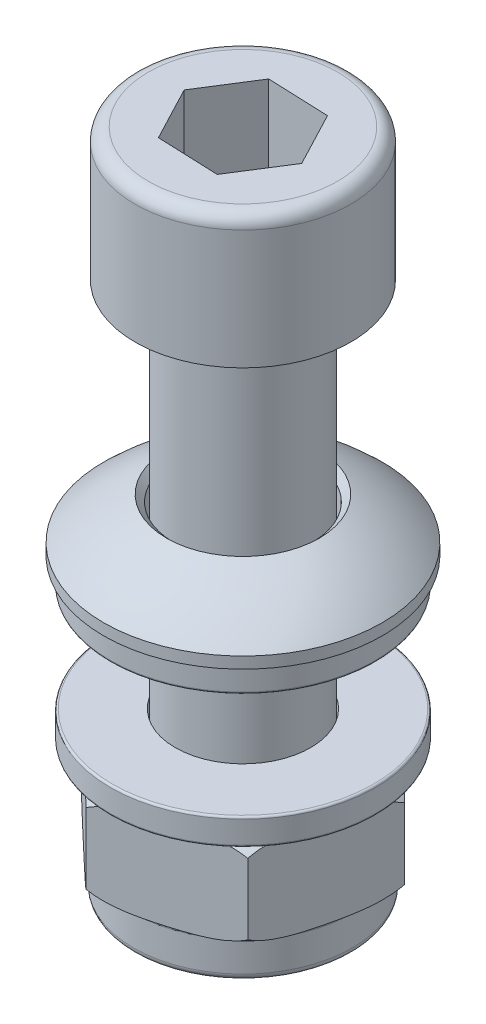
ISO-10303-21;
HEADER;
FILE_DESCRIPTION(('STEP AP214'),'2;1');
FILE_NAME('part.step','',(''),(''),'','','');
FILE_SCHEMA(('AUTOMOTIVE_DESIGN { 1 0 10303 214 1 1 1 1 }'));
ENDSEC;
DATA;
#1=APPLICATION_CONTEXT('core data for automotive mechanical design processes');
#2=APPLICATION_PROTOCOL_DEFINITION('international standard','automotive_design',2000,#1);
#3=PRODUCT_CONTEXT('',#1,'mechanical');
#4=PRODUCT('Part','Part','',(#3));
#5=PRODUCT_RELATED_PRODUCT_CATEGORY('part','',(#4));
#6=PRODUCT_DEFINITION_FORMATION('','',#4);
#7=PRODUCT_DEFINITION_CONTEXT('part definition',#1,'design');
#8=PRODUCT_DEFINITION('design','',#6,#7);
#9=PRODUCT_DEFINITION_SHAPE('','',#8);
#10=(LENGTH_UNIT() NAMED_UNIT(*) SI_UNIT(.MILLI.,.METRE.));
#11=(NAMED_UNIT(*) PLANE_ANGLE_UNIT() SI_UNIT($,.RADIAN.));
#12=(NAMED_UNIT(*) SI_UNIT($,.STERADIAN.) SOLID_ANGLE_UNIT());
#13=UNCERTAINTY_MEASURE_WITH_UNIT(LENGTH_MEASURE(1.E-05),#10,'distance_accuracy_value','');
#14=(GEOMETRIC_REPRESENTATION_CONTEXT(3) GLOBAL_UNCERTAINTY_ASSIGNED_CONTEXT((#13)) GLOBAL_UNIT_ASSIGNED_CONTEXT((#10,
#11,#12)) REPRESENTATION_CONTEXT('',''));
#15=CARTESIAN_POINT('',(0.,0.,0.));
#16=DIRECTION('',(0.,0.,1.));
#17=DIRECTION('',(1.,0.,0.));
#18=AXIS2_PLACEMENT_3D('',#15,#16,#17);
#19=CARTESIAN_POINT('',(0.,-18.15,0.));
#20=DIRECTION('',(0.,1.,0.));
#21=DIRECTION('',(0.,0.,1.));
#22=AXIS2_PLACEMENT_3D('',#19,#20,#21);
#23=CYLINDRICAL_SURFACE('',#22,10.5);
#24=CARTESIAN_POINT('',(0.,-18.,0.));
#25=DIRECTION('',(0.,1.,0.));
#26=DIRECTION('',(0.,0.,1.));
#27=AXIS2_PLACEMENT_3D('',#24,#25,#26);
#28=CIRCLE('',#27,10.5);
#29=CARTESIAN_POINT('',(0.,-18.,10.5));
#30=VERTEX_POINT('',#29);
#31=EDGE_CURVE('E11',#30,#30,#28,.T.);
#32=ORIENTED_EDGE('',*,*,#31,.T.);
#33=EDGE_LOOP('',(#32));
#34=FACE_BOUND('',#33,.T.);
#35=CARTESIAN_POINT('',(0.,-17.1420083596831,0.));
#36=DIRECTION('',(0.,1.,0.));
#37=DIRECTION('',(0.,0.,1.));
#38=AXIS2_PLACEMENT_3D('',#35,#36,#37);
#39=CIRCLE('',#38,10.5);
#40=CARTESIAN_POINT('',(10.5,-17.1420083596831,0.));
#41=VERTEX_POINT('',#40);
#42=EDGE_CURVE('E65',#41,#41,#39,.T.);
#43=ORIENTED_EDGE('',*,*,#42,.F.);
#44=EDGE_LOOP('',(#43));
#45=FACE_BOUND('',#44,.T.);
#46=ADVANCED_FACE('F43',(#34,#45),#23,.T.);
#47=CARTESIAN_POINT('',(6.05,-18.,0.));
#48=DIRECTION('',(0.,-1.,0.));
#49=DIRECTION('',(0.,0.,-1.));
#50=AXIS2_PLACEMENT_3D('',#47,#48,#49);
#51=PLANE('',#50);
#52=CARTESIAN_POINT('',(0.,-18.,0.));
#53=DIRECTION('',(0.,1.,0.));
#54=DIRECTION('',(0.,0.,1.));
#55=AXIS2_PLACEMENT_3D('',#52,#53,#54);
#56=CIRCLE('',#55,6.05);
#57=CARTESIAN_POINT('',(0.,-18.,6.05));
#58=VERTEX_POINT('',#57);
#59=EDGE_CURVE('E49',#58,#58,#56,.T.);
#60=ORIENTED_EDGE('',*,*,#59,.T.);
#61=EDGE_LOOP('',(#60));
#62=FACE_BOUND('',#61,.T.);
#63=ORIENTED_EDGE('',*,*,#31,.F.);
#64=EDGE_LOOP('',(#63));
#65=FACE_BOUND('',#64,.T.);
#66=ADVANCED_FACE('F73',(#62,#65),#51,.T.);
#67=CARTESIAN_POINT('',(0.,-18.,0.));
#68=DIRECTION('',(0.,-1.,0.));
#69=DIRECTION('',(0.,0.,-1.));
#70=AXIS2_PLACEMENT_3D('',#67,#68,#69);
#71=CONICAL_SURFACE('',#70,6.05,0.785398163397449);
#72=CARTESIAN_POINT('',(0.,-17.2,0.));
#73=DIRECTION('',(0.,1.,0.));
#74=DIRECTION('',(0.,0.,1.));
#75=AXIS2_PLACEMENT_3D('',#72,#73,#74);
#76=CIRCLE('',#75,5.25);
#77=CARTESIAN_POINT('',(0.,-17.2,5.25));
#78=VERTEX_POINT('',#77);
#79=EDGE_CURVE('E53',#78,#78,#76,.T.);
#80=ORIENTED_EDGE('',*,*,#79,.T.);
#81=EDGE_LOOP('',(#80));
#82=FACE_BOUND('',#81,.T.);
#83=ORIENTED_EDGE('',*,*,#59,.F.);
#84=EDGE_LOOP('',(#83));
#85=FACE_BOUND('',#84,.T.);
#86=ADVANCED_FACE('F77',(#82,#85),#71,.F.);
#87=CARTESIAN_POINT('',(0.,-18.15,0.));
#88=DIRECTION('',(0.,1.,0.));
#89=DIRECTION('',(0.,0.,1.));
#90=AXIS2_PLACEMENT_3D('',#87,#88,#89);
#91=CYLINDRICAL_SURFACE('',#90,5.25);
#92=CARTESIAN_POINT('',(0.,-14.5,0.));
#93=DIRECTION('',(0.,1.,0.));
#94=DIRECTION('',(0.,0.,1.));
#95=AXIS2_PLACEMENT_3D('',#92,#93,#94);
#96=CIRCLE('',#95,5.25);
#97=CARTESIAN_POINT('',(0.,-14.5,5.25));
#98=VERTEX_POINT('',#97);
#99=EDGE_CURVE('E57',#98,#98,#96,.T.);
#100=ORIENTED_EDGE('',*,*,#99,.T.);
#101=EDGE_LOOP('',(#100));
#102=FACE_BOUND('',#101,.T.);
#103=ORIENTED_EDGE('',*,*,#79,.F.);
#104=EDGE_LOOP('',(#103));
#105=FACE_BOUND('',#104,.T.);
#106=ADVANCED_FACE('F81',(#102,#105),#91,.F.);
#107=CARTESIAN_POINT('',(0.,-14.5,0.));
#108=DIRECTION('',(0.,1.,0.));
#109=DIRECTION('',(0.,0.,1.));
#110=AXIS2_PLACEMENT_3D('',#107,#108,#109);
#111=CONICAL_SURFACE('',#110,5.25,0.785398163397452);
#112=CARTESIAN_POINT('',(0.,-14.,0.));
#113=DIRECTION('',(0.,1.,0.));
#114=DIRECTION('',(0.,0.,1.));
#115=AXIS2_PLACEMENT_3D('',#112,#113,#114);
#116=CIRCLE('',#115,5.75);
#117=CARTESIAN_POINT('',(5.75,-14.,0.));
#118=VERTEX_POINT('',#117);
#119=EDGE_CURVE('E62',#118,#118,#116,.T.);
#120=ORIENTED_EDGE('',*,*,#119,.T.);
#121=EDGE_LOOP('',(#120));
#122=FACE_BOUND('',#121,.T.);
#123=ORIENTED_EDGE('',*,*,#99,.F.);
#124=EDGE_LOOP('',(#123));
#125=FACE_BOUND('',#124,.T.);
#126=ADVANCED_FACE('F88',(#122,#125),#111,.F.);
#127=CARTESIAN_POINT('',(0.,-27.8541510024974,0.));
#128=DIRECTION('',(0.,1.,0.));
#129=DIRECTION('',(1.,0.,0.));
#130=AXIS2_PLACEMENT_3D('',#127,#128,#129);
#131=SPHERICAL_SURFACE('',#130,15.);
#132=CARTESIAN_POINT('',(10.5,-17.1420083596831,0.));
#133=CARTESIAN_POINT('',(10.4573751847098,-17.1002276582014,0.));
#134=CARTESIAN_POINT('',(10.4145009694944,-17.0587013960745,0.));
#135=CARTESIAN_POINT('',(10.3282599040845,-16.9761636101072,0.));
#136=CARTESIAN_POINT('',(10.28489305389,-16.9351520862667,0.));
#137=CARTESIAN_POINT('',(10.1976728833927,-16.8536496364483,0.));
#138=CARTESIAN_POINT('',(10.15381956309,-16.8131587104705,0.));
#139=CARTESIAN_POINT('',(10.0656327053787,-16.7327032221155,0.));
#140=CARTESIAN_POINT('',(10.0212991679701,-16.6927386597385,0.));
#141=CARTESIAN_POINT('',(9.93215819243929,-16.6133415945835,0.));
#142=CARTESIAN_POINT('',(9.88735075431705,-16.5739090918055,0.));
#143=CARTESIAN_POINT('',(9.79726836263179,-16.4955817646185,0.));
#144=CARTESIAN_POINT('',(9.75199340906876,-16.4566869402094,0.));
#145=CARTESIAN_POINT('',(9.66098243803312,-16.3794405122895,0.));
#146=CARTESIAN_POINT('',(9.6152464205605,-16.3410889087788,0.));
#147=CARTESIAN_POINT('',(9.52331983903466,-16.2649343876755,0.));
#148=CARTESIAN_POINT('',(9.47712927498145,-16.2271314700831,0.));
#149=CARTESIAN_POINT('',(9.38430018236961,-16.152079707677,0.));
#150=CARTESIAN_POINT('',(9.33766165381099,-16.1148308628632,0.));
#151=CARTESIAN_POINT('',(9.24394327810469,-16.0408925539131,0.));
#152=CARTESIAN_POINT('',(9.19686343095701,-16.0042030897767,0.));
#153=CARTESIAN_POINT('',(9.10226912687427,-15.9313887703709,0.));
#154=CARTESIAN_POINT('',(9.05475466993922,-15.8952639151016,0.));
#155=CARTESIAN_POINT('',(8.9592979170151,-15.8235839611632,0.));
#156=CARTESIAN_POINT('',(8.91135562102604,-15.7880288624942,0.));
#157=CARTESIAN_POINT('',(8.81505002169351,-15.7174934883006,0.));
#158=CARTESIAN_POINT('',(8.76668671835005,-15.682513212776,0.));
#159=CARTESIAN_POINT('',(8.66954599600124,-15.613132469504,0.));
#160=CARTESIAN_POINT('',(8.62076857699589,-15.5787320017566,0.));
#161=CARTESIAN_POINT('',(8.52280657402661,-15.5105157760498,0.));
#162=CARTESIAN_POINT('',(8.47362199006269,-15.4767000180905,0.));
#163=CARTESIAN_POINT('',(8.37485266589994,-15.4096580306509,0.));
#164=CARTESIAN_POINT('',(8.32526792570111,-15.3764318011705,0.));
#165=CARTESIAN_POINT('',(8.22570535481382,-15.3105736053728,0.));
#166=CARTESIAN_POINT('',(8.17572752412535,-15.2779416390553,0.));
#167=CARTESIAN_POINT('',(8.07538589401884,-15.2132766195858,0.));
#168=CARTESIAN_POINT('',(8.02502209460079,-15.1812435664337,0.));
#169=CARTESIAN_POINT('',(7.92391570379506,-15.1177809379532,0.));
#170=CARTESIAN_POINT('',(7.87317311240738,-15.0863513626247,0.));
#171=CARTESIAN_POINT('',(7.77131636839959,-15.024100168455,0.));
#172=CARTESIAN_POINT('',(7.72020221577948,-14.9932785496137,0.));
#173=CARTESIAN_POINT('',(7.6176096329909,-14.9322476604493,0.));
#174=CARTESIAN_POINT('',(7.56613120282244,-14.9020383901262,0.));
#175=CARTESIAN_POINT('',(7.4628174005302,-14.8422365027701,0.));
#176=CARTESIAN_POINT('',(7.41098202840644,-14.8126438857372,0.));
#177=CARTESIAN_POINT('',(7.30696172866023,-14.7540795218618,0.));
#178=CARTESIAN_POINT('',(7.25477680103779,-14.7251077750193,0.));
#179=CARTESIAN_POINT('',(7.15006482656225,-14.6677892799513,0.));
#180=CARTESIAN_POINT('',(7.09753777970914,-14.6394425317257,0.));
#181=CARTESIAN_POINT('',(6.99214905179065,-14.5833780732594,0.));
#182=CARTESIAN_POINT('',(6.93928737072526,-14.5556603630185,0.));
#183=CARTESIAN_POINT('',(6.83323690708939,-14.5008579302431,0.));
#184=CARTESIAN_POINT('',(6.7800481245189,-14.4737732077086,0.));
#185=CARTESIAN_POINT('',(6.67335103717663,-14.4202406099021,0.));
#186=CARTESIAN_POINT('',(6.61984273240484,-14.3937927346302,0.));
#187=CARTESIAN_POINT('',(6.51251422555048,-14.3415376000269,0.));
#188=CARTESIAN_POINT('',(6.45869402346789,-14.3157303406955,0.));
#189=CARTESIAN_POINT('',(6.35074939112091,-14.2647601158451,0.));
#190=CARTESIAN_POINT('',(6.29662496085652,-14.2395971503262,0.));
#191=CARTESIAN_POINT('',(6.18807958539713,-14.1899190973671,0.));
#192=CARTESIAN_POINT('',(6.13365864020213,-14.165404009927,0.));
#193=CARTESIAN_POINT('',(6.0245279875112,-14.117025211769,0.));
#194=CARTESIAN_POINT('',(5.96981828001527,-14.0931615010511,0.));
#195=CARTESIAN_POINT('',(5.8601179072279,-14.0460888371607,0.));
#196=CARTESIAN_POINT('',(5.80512724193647,-14.0228798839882,0.));
#197=CARTESIAN_POINT('',(5.75,-14.,0.));
#198=B_SPLINE_CURVE_WITH_KNOTS('',3,(#132,#133,#134,#135,#136,#137,#138,#139,#140,#141,#142,
#143,#144,#145,#146,#147,#148,#149,#150,#151,#152,#153,#154,#155,#156,#157,#158,#159,#160,#161,
#162,#163,#164,#165,#166,#167,#168,#169,#170,#171,#172,#173,#174,#175,#176,#177,#178,#179,#180,
#181,#182,#183,#184,#185,#186,#187,#188,#189,#190,#191,#192,#193,#194,#195,#196,#197),
.UNSPECIFIED.,.F.,.F.,(4,2,2,2,2,2,2,2,2,2,2,2,2,2,2,2,2,2,2,2,2,2,2,2,2,2,2,2,2,2,2,2,4),(0.,
0.179059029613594,0.358118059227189,0.53717708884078,0.716236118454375,0.895295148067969,
1.07435417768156,1.25341320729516,1.43247223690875,1.61153126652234,1.79059029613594,
1.96964932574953,2.14870835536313,2.32776738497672,2.50682641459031,2.68588544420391,
2.8649444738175,3.04400350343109,3.22306253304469,3.40212156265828,3.58118059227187,
3.76023962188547,3.93929865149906,4.11835768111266,4.29741671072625,4.47647574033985,
4.65553476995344,4.83459379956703,5.01365282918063,5.19271185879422,5.37177088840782,
5.55082991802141,5.729888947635),.UNSPECIFIED.);
#199=EDGE_CURVE('BSEAM69',#41,#118,#198,.T.);
#200=ORIENTED_EDGE('',*,*,#42,.T.);
#201=ORIENTED_EDGE('',*,*,#119,.F.);
#202=ORIENTED_EDGE('',*,*,#199,.T.);
#203=ORIENTED_EDGE('',*,*,#199,.F.);
#204=EDGE_LOOP('',(#200,#202,#201,#203));
#205=FACE_BOUND('',#204,.T.);
#206=ADVANCED_FACE('F69',(#205),#131,.T.);
#207=CLOSED_SHELL('',(#46,#66,#86,#106,#126,#206));
#208=MANIFOLD_SOLID_BREP('B2',#207);
#209=CARTESIAN_POINT('',(0.,10.,0.));
#210=DIRECTION('',(0.,1.,0.));
#211=DIRECTION('',(0.,0.,1.));
#212=AXIS2_PLACEMENT_3D('',#209,#210,#211);
#213=CYLINDRICAL_SURFACE('',#212,5.1);
#214=CARTESIAN_POINT('',(0.,-20.,0.));
#215=DIRECTION('',(0.,1.,0.));
#216=DIRECTION('',(0.,0.,1.));
#217=AXIS2_PLACEMENT_3D('',#214,#215,#216);
#218=CIRCLE('',#217,5.1);
#219=CARTESIAN_POINT('',(0.,-20.,5.1));
#220=VERTEX_POINT('',#219);
#221=EDGE_CURVE('E42',#220,#220,#218,.T.);
#222=ORIENTED_EDGE('',*,*,#221,.F.);
#223=EDGE_LOOP('',(#222));
#224=FACE_BOUND('',#223,.T.);
#225=CARTESIAN_POINT('',(0.,-18.,0.));
#226=DIRECTION('',(0.,1.,0.));
#227=DIRECTION('',(0.,0.,1.));
#228=AXIS2_PLACEMENT_3D('',#225,#226,#227);
#229=CIRCLE('',#228,5.1);
#230=CARTESIAN_POINT('',(0.,-18.,5.1));
#231=VERTEX_POINT('',#230);
#232=EDGE_CURVE('E166',#231,#231,#229,.T.);
#233=ORIENTED_EDGE('',*,*,#232,.T.);
#234=EDGE_LOOP('',(#233));
#235=FACE_BOUND('',#234,.T.);
#236=ADVANCED_FACE('F144',(#224,#235),#213,.F.);
#237=CARTESIAN_POINT('',(5.1,-20.,0.));
#238=DIRECTION('',(0.,1.,0.));
#239=DIRECTION('',(0.,0.,1.));
#240=AXIS2_PLACEMENT_3D('',#237,#238,#239);
#241=PLANE('',#240);
#242=CARTESIAN_POINT('',(0.,-20.,0.));
#243=DIRECTION('',(0.,1.,0.));
#244=DIRECTION('',(0.,0.,1.));
#245=AXIS2_PLACEMENT_3D('',#242,#243,#244);
#246=CIRCLE('',#245,9.85);
#247=CARTESIAN_POINT('',(0.,-20.,9.85));
#248=VERTEX_POINT('',#247);
#249=EDGE_CURVE('E150',#248,#248,#246,.T.);
#250=ORIENTED_EDGE('',*,*,#249,.F.);
#251=EDGE_LOOP('',(#250));
#252=FACE_BOUND('',#251,.T.);
#253=ORIENTED_EDGE('',*,*,#221,.T.);
#254=EDGE_LOOP('',(#253));
#255=FACE_BOUND('',#254,.T.);
#256=ADVANCED_FACE('F191',(#252,#255),#241,.F.);
#257=CARTESIAN_POINT('',(0.,-19.85,0.));
#258=DIRECTION('',(0.,1.,0.));
#259=DIRECTION('',(0.,0.,1.));
#260=AXIS2_PLACEMENT_3D('',#257,#258,#259);
#261=TOROIDAL_SURFACE('',#260,9.85,0.150000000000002);
#262=CARTESIAN_POINT('',(0.,-19.85,0.));
#263=DIRECTION('',(0.,1.,0.));
#264=DIRECTION('',(0.,0.,1.));
#265=AXIS2_PLACEMENT_3D('',#262,#263,#264);
#266=CIRCLE('',#265,10.);
#267=CARTESIAN_POINT('',(0.,-19.85,10.));
#268=VERTEX_POINT('',#267);
#269=EDGE_CURVE('E154',#268,#268,#266,.T.);
#270=ORIENTED_EDGE('',*,*,#269,.F.);
#271=EDGE_LOOP('',(#270));
#272=FACE_BOUND('',#271,.T.);
#273=ORIENTED_EDGE('',*,*,#249,.T.);
#274=EDGE_LOOP('',(#273));
#275=FACE_BOUND('',#274,.T.);
#276=ADVANCED_FACE('F186',(#272,#275),#261,.T.);
#277=CARTESIAN_POINT('',(0.,10.,0.));
#278=DIRECTION('',(0.,1.,0.));
#279=DIRECTION('',(0.,0.,1.));
#280=AXIS2_PLACEMENT_3D('',#277,#278,#279);
#281=CYLINDRICAL_SURFACE('',#280,10.);
#282=CARTESIAN_POINT('',(0.,-18.15,0.));
#283=DIRECTION('',(0.,1.,0.));
#284=DIRECTION('',(0.,0.,1.));
#285=AXIS2_PLACEMENT_3D('',#282,#283,#284);
#286=CIRCLE('',#285,10.);
#287=CARTESIAN_POINT('',(0.,-18.15,10.));
#288=VERTEX_POINT('',#287);
#289=EDGE_CURVE('E158',#288,#288,#286,.T.);
#290=ORIENTED_EDGE('',*,*,#289,.F.);
#291=EDGE_LOOP('',(#290));
#292=FACE_BOUND('',#291,.T.);
#293=ORIENTED_EDGE('',*,*,#269,.T.);
#294=EDGE_LOOP('',(#293));
#295=FACE_BOUND('',#294,.T.);
#296=ADVANCED_FACE('F180',(#292,#295),#281,.T.);
#297=CARTESIAN_POINT('',(0.,-18.15,0.));
#298=DIRECTION('',(0.,1.,0.));
#299=DIRECTION('',(0.,0.,1.));
#300=AXIS2_PLACEMENT_3D('',#297,#298,#299);
#301=TOROIDAL_SURFACE('',#300,9.85,0.149999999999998);
#302=CARTESIAN_POINT('',(0.,-18.,0.));
#303=DIRECTION('',(0.,1.,0.));
#304=DIRECTION('',(0.,0.,1.));
#305=AXIS2_PLACEMENT_3D('',#302,#303,#304);
#306=CIRCLE('',#305,9.85);
#307=CARTESIAN_POINT('',(0.,-18.,9.85));
#308=VERTEX_POINT('',#307);
#309=EDGE_CURVE('E163',#308,#308,#306,.T.);
#310=ORIENTED_EDGE('',*,*,#309,.F.);
#311=EDGE_LOOP('',(#310));
#312=FACE_BOUND('',#311,.T.);
#313=ORIENTED_EDGE('',*,*,#289,.T.);
#314=EDGE_LOOP('',(#313));
#315=FACE_BOUND('',#314,.T.);
#316=ADVANCED_FACE('F174',(#312,#315),#301,.T.);
#317=CARTESIAN_POINT('',(5.1,-18.,0.));
#318=DIRECTION('',(0.,-1.,0.));
#319=DIRECTION('',(0.,0.,-1.));
#320=AXIS2_PLACEMENT_3D('',#317,#318,#319);
#321=PLANE('',#320);
#322=ORIENTED_EDGE('',*,*,#232,.F.);
#323=EDGE_LOOP('',(#322));
#324=FACE_BOUND('',#323,.T.);
#325=ORIENTED_EDGE('',*,*,#309,.T.);
#326=EDGE_LOOP('',(#325));
#327=FACE_BOUND('',#326,.T.);
#328=ADVANCED_FACE('F171',(#324,#327),#321,.F.);
#329=CLOSED_SHELL('',(#236,#256,#276,#296,#316,#328));
#330=MANIFOLD_SOLID_BREP('B6',#329);
#331=CARTESIAN_POINT('',(8.,-33.5,0.));
#332=DIRECTION('',(0.,0.,1.));
#333=DIRECTION('',(0.,1.,0.));
#334=AXIS2_PLACEMENT_3D('',#331,#332,#333);
#335=ELLIPSE('',#334,3.5,2.8);
#336=CARTESIAN_POINT('',(0.,0.,0.));
#337=DIRECTION('',(0.,1.,0.));
#338=AXIS1_PLACEMENT('',#336,#337);
#339=SURFACE_OF_REVOLUTION('',#335,#338);
#340=CARTESIAN_POINT('',(0.,-30.,0.));
#341=DIRECTION('',(0.,1.,0.));
#342=DIRECTION('',(0.,0.,1.));
#343=AXIS2_PLACEMENT_3D('',#340,#341,#342);
#344=CIRCLE('',#343,8.);
#345=CARTESIAN_POINT('',(0.,-30.,8.));
#346=VERTEX_POINT('',#345);
#347=EDGE_CURVE('E437',#346,#346,#344,.T.);
#348=ORIENTED_EDGE('',*,*,#347,.F.);
#349=EDGE_LOOP('',(#348));
#350=FACE_BOUND('',#349,.T.);
#351=CARTESIAN_POINT('',(-9.41077084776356,-30.8348487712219,2.78760208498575));
#352=CARTESIAN_POINT('',(-9.395610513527,-30.8002973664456,2.72445461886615));
#353=CARTESIAN_POINT('',(-9.3802482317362,-30.7674001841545,2.66046597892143));
#354=CARTESIAN_POINT('',(-9.34921558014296,-30.7048296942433,2.53120541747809));
#355=CARTESIAN_POINT('',(-9.33354606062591,-30.6751486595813,2.46593703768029));
#356=CARTESIAN_POINT('',(-9.30193732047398,-30.6187891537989,2.33427688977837));
#357=CARTESIAN_POINT('',(-9.28599842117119,-30.5921073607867,2.26788646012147));
#358=CARTESIAN_POINT('',(-9.25388577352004,-30.5415359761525,2.13412738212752));
#359=CARTESIAN_POINT('',(-9.23771207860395,-30.5176457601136,2.06675895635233));
#360=CARTESIAN_POINT('',(-9.20510275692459,-30.4723750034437,1.9309310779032));
#361=CARTESIAN_POINT('',(-9.18866633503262,-30.4510050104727,1.86246831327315));
#362=CARTESIAN_POINT('',(-9.15562586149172,-30.4106891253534,1.72484455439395));
#363=CARTESIAN_POINT('',(-9.13902174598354,-30.3917441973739,1.65568329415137));
#364=CARTESIAN_POINT('',(-9.10568031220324,-30.3560944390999,1.5168059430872));
#365=CARTESIAN_POINT('',(-9.08894297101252,-30.3393900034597,1.44708975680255));
#366=CARTESIAN_POINT('',(-9.05536967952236,-30.3080444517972,1.30724664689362));
#367=CARTESIAN_POINT('',(-9.03853376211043,-30.2934026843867,1.23711986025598));
#368=CARTESIAN_POINT('',(-8.97293089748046,-30.240121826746,0.963863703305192));
#369=CARTESIAN_POINT('',(-8.92385752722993,-30.2083343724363,0.759457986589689));
#370=CARTESIAN_POINT('',(-8.82537879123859,-30.1563027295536,0.349263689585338));
#371=CARTESIAN_POINT('',(-8.77597327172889,-30.1360643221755,0.143474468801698));
#372=CARTESIAN_POINT('',(-8.67691474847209,-30.1037810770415,-0.269134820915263));
#373=CARTESIAN_POINT('',(-8.62726144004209,-30.0917541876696,-0.475956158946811));
#374=CARTESIAN_POINT('',(-8.52779617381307,-30.0734297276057,-0.890259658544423));
#375=CARTESIAN_POINT('',(-8.47798410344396,-30.0671444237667,-1.09774228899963));
#376=CARTESIAN_POINT('',(-8.37827466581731,-30.0587393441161,-1.51306283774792));
#377=CARTESIAN_POINT('',(-8.32837727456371,-30.0566252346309,-1.72090085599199));
#378=CARTESIAN_POINT('',(-8.22854394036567,-30.0559729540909,-2.13673747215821));
#379=CARTESIAN_POINT('',(-8.17860799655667,-30.0574374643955,-2.34473607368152));
#380=CARTESIAN_POINT('',(-8.07882551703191,-30.0643676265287,-2.7603608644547));
#381=CARTESIAN_POINT('',(-8.02897896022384,-30.0698272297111,-2.96798714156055));
#382=CARTESIAN_POINT('',(-7.92943179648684,-30.0861556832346,-3.38263176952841));
#383=CARTESIAN_POINT('',(-7.87973109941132,-30.09701346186,-3.58965049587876));
#384=CARTESIAN_POINT('',(-7.78054660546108,-30.1264670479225,-4.00278449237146));
#385=CARTESIAN_POINT('',(-7.73106257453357,-30.1450476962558,-4.20890073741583));
#386=CARTESIAN_POINT('',(-7.63237805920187,-30.1931439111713,-4.6199521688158));
#387=CARTESIAN_POINT('',(-7.5831774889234,-30.2226559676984,-4.82488771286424));
#388=CARTESIAN_POINT('',(-7.51628429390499,-30.2731981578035,-5.10351849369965));
#389=CARTESIAN_POINT('',(-7.49832487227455,-30.2878063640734,-5.17832502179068));
#390=CARTESIAN_POINT('',(-7.46250737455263,-30.319264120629,-5.32751594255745));
#391=CARTESIAN_POINT('',(-7.44464932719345,-30.3361142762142,-5.40190021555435));
#392=CARTESIAN_POINT('',(-7.40907364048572,-30.3722696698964,-5.55008391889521));
#393=CARTESIAN_POINT('',(-7.39135596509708,-30.3915742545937,-5.62388349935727));
#394=CARTESIAN_POINT('',(-7.3561000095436,-30.4328607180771,-5.7707354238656));
#395=CARTESIAN_POINT('',(-7.33856164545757,-30.4548412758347,-5.84378811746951));
#396=CARTESIAN_POINT('',(-7.30379117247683,-30.501590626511,-5.98861785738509));
#397=CARTESIAN_POINT('',(-7.28655792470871,-30.5263438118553,-6.06039964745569));
#398=CARTESIAN_POINT('',(-7.25234599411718,-30.5789627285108,-6.20290288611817));
#399=CARTESIAN_POINT('',(-7.23536738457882,-30.6068293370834,-6.27362402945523));
#400=CARTESIAN_POINT('',(-7.20170367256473,-30.6659244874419,-6.41384376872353));
#401=CARTESIAN_POINT('',(-7.185018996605,-30.6971575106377,-6.4833405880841));
#402=CARTESIAN_POINT('',(-7.15198603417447,-30.7632460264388,-6.62093306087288));
#403=CARTESIAN_POINT('',(-7.13563888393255,-30.7981119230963,-6.68902398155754));
#404=CARTESIAN_POINT('',(-7.11951964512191,-30.8348487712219,-6.75616558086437));
#405=B_SPLINE_CURVE_WITH_KNOTS('',3,(#351,#352,#353,#354,#355,#356,#357,#358,#359,#360,#361,
#362,#363,#364,#365,#366,#367,#368,#369,#370,#371,#372,#373,#374,#375,#376,#377,#378,#379,#380,
#381,#382,#383,#384,#385,#386,#387,#388,#389,#390,#391,#392,#393,#394,#395,#396,#397,#398,#399,
#400,#401,#402,#403,#404),.UNSPECIFIED.,.F.,.F.,(4,2,2,2,2,2,2,2,2,2,2,2,2,2,2,2,2,2,2,2,2,2,2,
2,2,2,4),(0.,0.220640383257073,0.440738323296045,0.660590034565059,0.880392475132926,
1.10108443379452,1.32186386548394,1.54268213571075,1.76343051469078,2.40072142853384,
3.0383310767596,3.67732996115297,4.31769089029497,4.95892111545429,5.60063194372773,
6.24137321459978,6.8808057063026,7.51898894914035,8.15696744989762,8.39186134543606,
8.62681878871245,8.86171381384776,9.09649334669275,9.33001204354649,9.56359670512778,
9.79749625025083,10.0320850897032),.UNSPECIFIED.);
#406=CARTESIAN_POINT('',(-9.41077084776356,-30.8348487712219,2.78760208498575));
#407=VERTEX_POINT('',#406);
#408=CARTESIAN_POINT('',(-7.1195196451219,-30.8348487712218,-6.75616558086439));
#409=VERTEX_POINT('',#408);
#410=EDGE_CURVE('E142',#407,#409,#405,.T.);
#411=ORIENTED_EDGE('',*,*,#410,.F.);
#412=CARTESIAN_POINT('',(-2.29125120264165,-30.8348487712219,9.54376766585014));
#413=CARTESIAN_POINT('',(-2.33835834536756,-30.8002973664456,9.49906469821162));
#414=CARTESIAN_POINT('',(-2.3860929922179,-30.7674001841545,9.45376625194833));
#415=CARTESIAN_POINT('',(-2.48251959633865,-30.7048296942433,9.36226090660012));
#416=CARTESIAN_POINT('',(-2.53120891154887,-30.6751486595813,9.31605651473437));
#417=CARTESIAN_POINT('',(-2.62942557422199,-30.6187891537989,9.22285246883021));
#418=CARTESIAN_POINT('',(-2.67895192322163,-30.5921073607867,9.17585376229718));
#419=CARTESIAN_POINT('',(-2.7787343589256,-30.5415359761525,9.08116385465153));
#420=CARTESIAN_POINT('',(-2.82899027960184,-30.5176457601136,9.03347281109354));
#421=CARTESIAN_POINT('',(-2.93031601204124,-30.4723750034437,8.93731837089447));
#422=CARTESIAN_POINT('',(-2.9813882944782,-30.4510050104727,8.88885262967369));
#423=CARTESIAN_POINT('',(-3.08405372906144,-30.4106891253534,8.7914268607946));
#424=CARTESIAN_POINT('',(-3.13564707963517,-30.3917441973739,8.74246664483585));
#425=CARTESIAN_POINT('',(-3.23924767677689,-30.3560944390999,8.64415344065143));
#426=CARTESIAN_POINT('',(-3.291254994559,-30.3393900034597,8.59480038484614));
#427=CARTESIAN_POINT('',(-3.39557603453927,-30.3080444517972,8.49580350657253));
#428=CARTESIAN_POINT('',(-3.44788965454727,-30.2934026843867,8.44615978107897));
#429=CARTESIAN_POINT('',(-3.65173499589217,-30.240121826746,8.25271795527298));
#430=CARTESIAN_POINT('',(-3.8042188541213,-30.2083343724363,8.10801631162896));
#431=CARTESIAN_POINT('',(-4.11021816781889,-30.1563027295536,7.8176340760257));
#432=CARTESIAN_POINT('',(-4.26373410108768,-30.1360643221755,7.67195303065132));
#433=CARTESIAN_POINT('',(-4.57153496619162,-30.1037810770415,7.37986118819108));
#434=CARTESIAN_POINT('',(-4.72582084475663,-30.0917541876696,7.23344949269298));
#435=CARTESIAN_POINT('',(-5.03488556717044,-30.0734297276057,6.94015829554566));
#436=CARTESIAN_POINT('',(-5.18966476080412,-30.0671444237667,6.79327846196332));
#437=CARTESIAN_POINT('',(-5.4994881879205,-30.0587393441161,6.49926728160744));
#438=CARTESIAN_POINT('',(-5.65453249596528,-30.0566252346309,6.35213586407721));
#439=CARTESIAN_POINT('',(-5.96474090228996,-30.0559729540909,6.0577593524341));
#440=CARTESIAN_POINT('',(-6.11990500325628,-30.0574374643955,5.91051425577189));
#441=CARTESIAN_POINT('',(-6.42995539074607,-30.0643676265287,5.61628769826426));
#442=CARTESIAN_POINT('',(-6.58484174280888,-30.0698272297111,5.46930617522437));
#443=CARTESIAN_POINT('',(-6.8941609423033,-30.0861556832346,5.17577348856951));
#444=CARTESIAN_POINT('',(-7.04859406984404,-30.09701346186,5.02922205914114));
#445=CARTESIAN_POINT('',(-7.35678635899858,-30.1264670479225,4.73675876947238));
#446=CARTESIAN_POINT('',(-7.51054624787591,-30.1450476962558,4.59084621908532));
#447=CARTESIAN_POINT('',(-7.81718497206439,-30.1931439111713,4.29985720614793));
#448=CARTESIAN_POINT('',(-7.97006407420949,-30.2226559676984,4.15478049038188));
#449=CARTESIAN_POINT('',(-8.17791881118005,-30.2731981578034,3.95753389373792));
#450=CARTESIAN_POINT('',(-8.23372345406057,-30.2878063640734,3.90457731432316));
#451=CARTESIAN_POINT('',(-8.34501783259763,-30.3192641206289,3.7989629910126));
#452=CARTESIAN_POINT('',(-8.4005074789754,-30.3361142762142,3.74630533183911));
#453=CARTESIAN_POINT('',(-8.51105048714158,-30.3722696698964,3.64140403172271));
#454=CARTESIAN_POINT('',(-8.56610396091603,-30.3915742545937,3.58916028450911));
#455=CARTESIAN_POINT('',(-8.67565348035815,-30.4328607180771,3.48520176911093));
#456=CARTESIAN_POINT('',(-8.730149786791,-30.4548412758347,3.43348675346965));
#457=CARTESIAN_POINT('',(-8.83819078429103,-30.501590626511,3.33095977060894));
#458=CARTESIAN_POINT('',(-8.89173901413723,-30.5263438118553,3.28014444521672));
#459=CARTESIAN_POINT('',(-8.99804447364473,-30.5789627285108,3.17926442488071));
#460=CARTESIAN_POINT('',(-9.05080147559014,-30.6068293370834,3.12919994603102));
#461=CARTESIAN_POINT('',(-9.15540347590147,-30.6659244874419,3.02993644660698));
#462=CARTESIAN_POINT('',(-9.20724714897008,-30.6971575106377,2.98073868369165));
#463=CARTESIAN_POINT('',(-9.30988924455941,-30.7632460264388,2.88333506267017));
#464=CARTESIAN_POINT('',(-9.36068413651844,-30.7981119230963,2.83513255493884));
#465=CARTESIAN_POINT('',(-9.41077084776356,-30.8348487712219,2.78760208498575));
#466=B_SPLINE_CURVE_WITH_KNOTS('',3,(#412,#413,#414,#415,#416,#417,#418,#419,#420,#421,#422,
#423,#424,#425,#426,#427,#428,#429,#430,#431,#432,#433,#434,#435,#436,#437,#438,#439,#440,#441,
#442,#443,#444,#445,#446,#447,#448,#449,#450,#451,#452,#453,#454,#455,#456,#457,#458,#459,#460,
#461,#462,#463,#464,#465),.UNSPECIFIED.,.F.,.F.,(4,2,2,2,2,2,2,2,2,2,2,2,2,2,2,2,2,2,2,2,2,2,2,
2,2,2,4),(0.,0.220640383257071,0.440738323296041,0.660590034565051,0.880392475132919,
1.10108443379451,1.32186386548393,1.54268213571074,1.76343051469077,2.40072142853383,
3.03833107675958,3.67732996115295,4.31769089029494,4.95892111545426,5.60063194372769,
6.24137321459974,6.88080570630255,7.5189889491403,8.15696744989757,8.39186134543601,
8.62681878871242,8.86171381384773,9.09649334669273,9.33001204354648,9.56359670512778,
9.79749625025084,10.0320850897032),.UNSPECIFIED.);
#467=CARTESIAN_POINT('',(-2.29125120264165,-30.8348487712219,9.54376766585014));
#468=VERTEX_POINT('',#467);
#469=EDGE_CURVE('E351',#468,#407,#466,.T.);
#470=ORIENTED_EDGE('',*,*,#469,.F.);
#471=CARTESIAN_POINT('',(7.11951964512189,-30.8348487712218,6.75616558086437));
#472=CARTESIAN_POINT('',(7.05725216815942,-30.8002973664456,6.77461007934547));
#473=CARTESIAN_POINT('',(6.99415523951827,-30.7674001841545,6.7933002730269));
#474=CARTESIAN_POINT('',(6.86669598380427,-30.7048296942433,6.83105548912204));
#475=CARTESIAN_POINT('',(6.802337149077,-30.6751486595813,6.85011947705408));
#476=CARTESIAN_POINT('',(6.67251174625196,-30.6187891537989,6.88857557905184));
#477=CARTESIAN_POINT('',(6.60704649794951,-30.5921073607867,6.90796730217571));
#478=CARTESIAN_POINT('',(6.47515141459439,-30.5415359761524,6.94703647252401));
#479=CARTESIAN_POINT('',(6.40872179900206,-30.5176457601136,6.96671385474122));
#480=CARTESIAN_POINT('',(6.27478674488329,-30.4723750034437,7.00638729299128));
#481=CARTESIAN_POINT('',(6.20727804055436,-30.4510050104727,7.02638431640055));
#482=CARTESIAN_POINT('',(6.07157213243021,-30.4106891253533,7.06658230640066));
#483=CARTESIAN_POINT('',(6.0033746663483,-30.3917441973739,7.08678335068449));
#484=CARTESIAN_POINT('',(5.86643263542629,-30.3560944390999,7.12734749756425));
#485=CARTESIAN_POINT('',(5.79768797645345,-30.3393900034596,7.1477106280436));
#486=CARTESIAN_POINT('',(5.65979364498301,-30.3080444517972,7.18855685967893));
#487=CARTESIAN_POINT('',(5.59064410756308,-30.2934026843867,7.209039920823));
#488=CARTESIAN_POINT('',(5.32119590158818,-30.240121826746,7.2888542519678));
#489=CARTESIAN_POINT('',(5.11963867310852,-30.2083343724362,7.34855832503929));
#490=CARTESIAN_POINT('',(4.71516062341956,-30.1563027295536,7.46837038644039));
#491=CARTESIAN_POINT('',(4.51223917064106,-30.1360643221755,7.52847856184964));
#492=CARTESIAN_POINT('',(4.1053797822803,-30.1037810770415,7.64899600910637));
#493=CARTESIAN_POINT('',(3.90144059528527,-30.0917541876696,7.70940565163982));
#494=CARTESIAN_POINT('',(3.49291060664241,-30.0734297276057,7.83041795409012));
#495=CARTESIAN_POINT('',(3.28831934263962,-30.0671444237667,7.89102075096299));
#496=CARTESIAN_POINT('',(2.87878647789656,-30.0587393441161,8.0123301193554));
#497=CARTESIAN_POINT('',(2.67384477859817,-30.0566252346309,8.07303672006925));
#498=CARTESIAN_POINT('',(2.26380303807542,-30.0559729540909,8.19449682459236));
#499=CARTESIAN_POINT('',(2.05870299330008,-30.0574374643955,8.25525032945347));
#500=CARTESIAN_POINT('',(1.64887012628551,-30.0643676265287,8.37664856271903));
#501=CARTESIAN_POINT('',(1.44413721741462,-30.0698272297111,8.43729331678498));
#502=CARTESIAN_POINT('',(1.03527085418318,-30.0861556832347,8.55840525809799));
#503=CARTESIAN_POINT('',(0.831137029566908,-30.09701346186,8.61887255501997));
#504=CARTESIAN_POINT('',(0.423760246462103,-30.1264670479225,8.73954326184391));
#505=CARTESIAN_POINT('',(0.22051632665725,-30.1450476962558,8.79974695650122));
#506=CARTESIAN_POINT('',(-0.184806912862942,-30.1931439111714,8.9198093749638));
#507=CARTESIAN_POINT('',(-0.38688658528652,-30.2226559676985,8.9796682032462));
#508=CARTESIAN_POINT('',(-0.661634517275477,-30.2731981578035,9.06105238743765));
#509=CARTESIAN_POINT('',(-0.735398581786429,-30.2878063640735,9.08290233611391));
#510=CARTESIAN_POINT('',(-0.882510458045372,-30.319264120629,9.12647893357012));
#511=CARTESIAN_POINT('',(-0.955858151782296,-30.3361142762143,9.14820554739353));
#512=CARTESIAN_POINT('',(-1.10197684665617,-30.3722696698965,9.19148795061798));
#513=CARTESIAN_POINT('',(-1.17474799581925,-30.3915742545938,9.21304378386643));
#514=CARTESIAN_POINT('',(-1.3195534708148,-30.4328607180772,9.25593719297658));
#515=CARTESIAN_POINT('',(-1.39158814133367,-30.4548412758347,9.27727487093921));
#516=CARTESIAN_POINT('',(-1.53439961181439,-30.501590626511,9.31957762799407));
#517=CARTESIAN_POINT('',(-1.6051810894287,-30.5263438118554,9.34054409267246));
#518=CARTESIAN_POINT('',(-1.74569847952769,-30.5789627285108,9.38216731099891));
#519=CARTESIAN_POINT('',(-1.81543409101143,-30.6068293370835,9.40282397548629));
#520=CARTESIAN_POINT('',(-1.95369980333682,-30.6659244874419,9.44378021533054));
#521=CARTESIAN_POINT('',(-2.02222815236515,-30.6971575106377,9.46407927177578));
#522=CARTESIAN_POINT('',(-2.15790321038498,-30.7632460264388,9.50426812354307));
#523=CARTESIAN_POINT('',(-2.22504525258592,-30.7981119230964,9.5241565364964));
#524=CARTESIAN_POINT('',(-2.29125120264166,-30.8348487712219,9.54376766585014));
#525=B_SPLINE_CURVE_WITH_KNOTS('',3,(#471,#472,#473,#474,#475,#476,#477,#478,#479,#480,#481,
#482,#483,#484,#485,#486,#487,#488,#489,#490,#491,#492,#493,#494,#495,#496,#497,#498,#499,#500,
#501,#502,#503,#504,#505,#506,#507,#508,#509,#510,#511,#512,#513,#514,#515,#516,#517,#518,#519,
#520,#521,#522,#523,#524),.UNSPECIFIED.,.F.,.F.,(4,2,2,2,2,2,2,2,2,2,2,2,2,2,2,2,2,2,2,2,2,2,2,
2,2,2,4),(0.,0.220640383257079,0.440738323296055,0.660590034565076,0.880392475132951,
1.10108443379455,1.32186386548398,1.5426821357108,1.76343051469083,2.40072142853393,
3.03833107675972,3.67732996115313,4.31769089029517,4.95892111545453,5.600631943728,
6.24137321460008,6.88080570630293,7.51898894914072,8.15696744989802,8.39186134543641,
8.62681878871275,8.86171381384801,9.09649334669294,9.33001204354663,9.56359670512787,
9.79749625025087,10.0320850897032),.UNSPECIFIED.);
#526=CARTESIAN_POINT('',(7.1195196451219,-30.8348487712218,6.75616558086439));
#527=VERTEX_POINT('',#526);
#528=EDGE_CURVE('E309',#527,#468,#525,.T.);
#529=ORIENTED_EDGE('',*,*,#528,.F.);
#530=CARTESIAN_POINT('',(9.41077084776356,-30.8348487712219,-2.78760208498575));
#531=CARTESIAN_POINT('',(9.395610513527,-30.8002973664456,-2.72445461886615));
#532=CARTESIAN_POINT('',(9.3802482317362,-30.7674001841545,-2.66046597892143));
#533=CARTESIAN_POINT('',(9.34921558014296,-30.7048296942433,-2.53120541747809));
#534=CARTESIAN_POINT('',(9.33354606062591,-30.6751486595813,-2.46593703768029));
#535=CARTESIAN_POINT('',(9.30193732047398,-30.6187891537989,-2.33427688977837));
#536=CARTESIAN_POINT('',(9.28599842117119,-30.5921073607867,-2.26788646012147));
#537=CARTESIAN_POINT('',(9.25388577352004,-30.5415359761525,-2.13412738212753));
#538=CARTESIAN_POINT('',(9.23771207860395,-30.5176457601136,-2.06675895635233));
#539=CARTESIAN_POINT('',(9.20510275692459,-30.4723750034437,-1.93093107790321));
#540=CARTESIAN_POINT('',(9.18866633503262,-30.4510050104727,-1.86246831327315));
#541=CARTESIAN_POINT('',(9.15562586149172,-30.4106891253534,-1.72484455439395));
#542=CARTESIAN_POINT('',(9.13902174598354,-30.3917441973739,-1.65568329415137));
#543=CARTESIAN_POINT('',(9.10568031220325,-30.3560944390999,-1.5168059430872));
#544=CARTESIAN_POINT('',(9.08894297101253,-30.3393900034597,-1.44708975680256));
#545=CARTESIAN_POINT('',(9.05536967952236,-30.3080444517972,-1.30724664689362));
#546=CARTESIAN_POINT('',(9.03853376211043,-30.2934026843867,-1.23711986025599));
#547=CARTESIAN_POINT('',(8.97293089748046,-30.240121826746,-0.9638637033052));
#548=CARTESIAN_POINT('',(8.92385752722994,-30.2083343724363,-0.759457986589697));
#549=CARTESIAN_POINT('',(8.82537879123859,-30.1563027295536,-0.349263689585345));
#550=CARTESIAN_POINT('',(8.77597327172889,-30.1360643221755,-0.143474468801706));
#551=CARTESIAN_POINT('',(8.67691474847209,-30.1037810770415,0.269134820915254));
#552=CARTESIAN_POINT('',(8.62726144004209,-30.0917541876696,0.475956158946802));
#553=CARTESIAN_POINT('',(8.52779617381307,-30.0734297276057,0.890259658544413));
#554=CARTESIAN_POINT('',(8.47798410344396,-30.0671444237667,1.09774228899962));
#555=CARTESIAN_POINT('',(8.37827466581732,-30.0587393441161,1.51306283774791));
#556=CARTESIAN_POINT('',(8.32837727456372,-30.0566252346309,1.72090085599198));
#557=CARTESIAN_POINT('',(8.22854394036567,-30.0559729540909,2.1367374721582));
#558=CARTESIAN_POINT('',(8.17860799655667,-30.0574374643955,2.34473607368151));
#559=CARTESIAN_POINT('',(8.07882551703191,-30.0643676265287,2.76036086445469));
#560=CARTESIAN_POINT('',(8.02897896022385,-30.0698272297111,2.96798714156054));
#561=CARTESIAN_POINT('',(7.92943179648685,-30.0861556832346,3.3826317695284));
#562=CARTESIAN_POINT('',(7.87973109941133,-30.09701346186,3.58965049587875));
#563=CARTESIAN_POINT('',(7.78054660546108,-30.1264670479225,4.00278449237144));
#564=CARTESIAN_POINT('',(7.73106257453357,-30.1450476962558,4.20890073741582));
#565=CARTESIAN_POINT('',(7.63237805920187,-30.1931439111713,4.61995216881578));
#566=CARTESIAN_POINT('',(7.58317748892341,-30.2226559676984,4.82488771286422));
#567=CARTESIAN_POINT('',(7.516284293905,-30.2731981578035,5.10351849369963));
#568=CARTESIAN_POINT('',(7.49832487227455,-30.2878063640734,5.17832502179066));
#569=CARTESIAN_POINT('',(7.46250737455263,-30.3192641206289,5.32751594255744));
#570=CARTESIAN_POINT('',(7.44464932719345,-30.3361142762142,5.40190021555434));
#571=CARTESIAN_POINT('',(7.40907364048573,-30.3722696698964,5.5500839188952));
#572=CARTESIAN_POINT('',(7.39135596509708,-30.3915742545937,5.62388349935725));
#573=CARTESIAN_POINT('',(7.3561000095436,-30.4328607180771,5.77073542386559));
#574=CARTESIAN_POINT('',(7.33856164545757,-30.4548412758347,5.8437881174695));
#575=CARTESIAN_POINT('',(7.30379117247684,-30.501590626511,5.98861785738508));
#576=CARTESIAN_POINT('',(7.28655792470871,-30.5263438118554,6.06039964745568));
#577=CARTESIAN_POINT('',(7.25234599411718,-30.5789627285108,6.20290288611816));
#578=CARTESIAN_POINT('',(7.23536738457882,-30.6068293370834,6.27362402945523));
#579=CARTESIAN_POINT('',(7.20170367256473,-30.6659244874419,6.41384376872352));
#580=CARTESIAN_POINT('',(7.185018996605,-30.6971575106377,6.4833405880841));
#581=CARTESIAN_POINT('',(7.15198603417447,-30.7632460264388,6.62093306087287));
#582=CARTESIAN_POINT('',(7.13563888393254,-30.7981119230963,6.68902398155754));
#583=CARTESIAN_POINT('',(7.11951964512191,-30.8348487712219,6.75616558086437));
#584=B_SPLINE_CURVE_WITH_KNOTS('',3,(#530,#531,#532,#533,#534,#535,#536,#537,#538,#539,#540,
#541,#542,#543,#544,#545,#546,#547,#548,#549,#550,#551,#552,#553,#554,#555,#556,#557,#558,#559,
#560,#561,#562,#563,#564,#565,#566,#567,#568,#569,#570,#571,#572,#573,#574,#575,#576,#577,#578,
#579,#580,#581,#582,#583),.UNSPECIFIED.,.F.,.F.,(4,2,2,2,2,2,2,2,2,2,2,2,2,2,2,2,2,2,2,2,2,2,2,
2,2,2,4),(0.,0.220640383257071,0.440738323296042,0.660590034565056,0.880392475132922,
1.10108443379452,1.32186386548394,1.54268213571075,1.76343051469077,2.40072142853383,
3.03833107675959,3.67732996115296,4.31769089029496,4.95892111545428,5.60063194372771,
6.24137321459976,6.88080570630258,7.51898894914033,8.15696744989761,8.39186134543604,
8.62681878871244,8.86171381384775,9.09649334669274,9.33001204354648,9.56359670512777,
9.79749625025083,10.0320850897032),.UNSPECIFIED.);
#585=CARTESIAN_POINT('',(9.41077084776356,-30.8348487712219,-2.78760208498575));
#586=VERTEX_POINT('',#585);
#587=EDGE_CURVE('E350',#586,#527,#584,.T.);
#588=ORIENTED_EDGE('',*,*,#587,.F.);
#589=CARTESIAN_POINT('',(2.29125120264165,-30.8348487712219,-9.54376766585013));
#590=CARTESIAN_POINT('',(2.33835834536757,-30.8002973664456,-9.49906469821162));
#591=CARTESIAN_POINT('',(2.38609299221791,-30.7674001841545,-9.45376625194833));
#592=CARTESIAN_POINT('',(2.48251959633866,-30.7048296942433,-9.36226090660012));
#593=CARTESIAN_POINT('',(2.53120891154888,-30.6751486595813,-9.31605651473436));
#594=CARTESIAN_POINT('',(2.62942557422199,-30.6187891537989,-9.22285246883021));
#595=CARTESIAN_POINT('',(2.67895192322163,-30.5921073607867,-9.17585376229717));
#596=CARTESIAN_POINT('',(2.7787343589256,-30.5415359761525,-9.08116385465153));
#597=CARTESIAN_POINT('',(2.82899027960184,-30.5176457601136,-9.03347281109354));
#598=CARTESIAN_POINT('',(2.93031601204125,-30.4723750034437,-8.93731837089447));
#599=CARTESIAN_POINT('',(2.98138829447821,-30.4510050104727,-8.88885262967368));
#600=CARTESIAN_POINT('',(3.08405372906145,-30.4106891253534,-8.79142686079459));
#601=CARTESIAN_POINT('',(3.13564707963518,-30.3917441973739,-8.74246664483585));
#602=CARTESIAN_POINT('',(3.23924767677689,-30.3560944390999,-8.64415344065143));
#603=CARTESIAN_POINT('',(3.291254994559,-30.3393900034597,-8.59480038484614));
#604=CARTESIAN_POINT('',(3.39557603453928,-30.3080444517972,-8.49580350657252));
#605=CARTESIAN_POINT('',(3.44788965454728,-30.2934026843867,-8.44615978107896));
#606=CARTESIAN_POINT('',(3.65173499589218,-30.240121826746,-8.25271795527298));
#607=CARTESIAN_POINT('',(3.80421885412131,-30.2083343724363,-8.10801631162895));
#608=CARTESIAN_POINT('',(4.11021816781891,-30.1563027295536,-7.81763407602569));
#609=CARTESIAN_POINT('',(4.26373410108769,-30.1360643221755,-7.6719530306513));
#610=CARTESIAN_POINT('',(4.57153496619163,-30.1037810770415,-7.37986118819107));
#611=CARTESIAN_POINT('',(4.72582084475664,-30.0917541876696,-7.23344949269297));
#612=CARTESIAN_POINT('',(5.03488556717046,-30.0734297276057,-6.94015829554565));
#613=CARTESIAN_POINT('',(5.18966476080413,-30.0671444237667,-6.7932784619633));
#614=CARTESIAN_POINT('',(5.49948818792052,-30.0587393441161,-6.49926728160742));
#615=CARTESIAN_POINT('',(5.6545324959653,-30.0566252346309,-6.35213586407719));
#616=CARTESIAN_POINT('',(5.96474090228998,-30.0559729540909,-6.05775935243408));
#617=CARTESIAN_POINT('',(6.11990500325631,-30.0574374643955,-5.91051425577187));
#618=CARTESIAN_POINT('',(6.42995539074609,-30.0643676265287,-5.61628769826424));
#619=CARTESIAN_POINT('',(6.58484174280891,-30.0698272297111,-5.46930617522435));
#620=CARTESIAN_POINT('',(6.89416094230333,-30.0861556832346,-5.17577348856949));
#621=CARTESIAN_POINT('',(7.04859406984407,-30.09701346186,-5.02922205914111));
#622=CARTESIAN_POINT('',(7.35678635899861,-30.1264670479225,-4.73675876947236));
#623=CARTESIAN_POINT('',(7.51054624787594,-30.1450476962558,-4.59084621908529));
#624=CARTESIAN_POINT('',(7.81718497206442,-30.1931439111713,-4.2998572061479));
#625=CARTESIAN_POINT('',(7.97006407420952,-30.2226559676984,-4.15478049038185));
#626=CARTESIAN_POINT('',(8.17791881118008,-30.2731981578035,-3.95753389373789));
#627=CARTESIAN_POINT('',(8.2337234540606,-30.2878063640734,-3.90457731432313));
#628=CARTESIAN_POINT('',(8.34501783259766,-30.319264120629,-3.79896299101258));
#629=CARTESIAN_POINT('',(8.40050747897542,-30.3361142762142,-3.74630533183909));
#630=CARTESIAN_POINT('',(8.5110504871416,-30.3722696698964,-3.64140403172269));
#631=CARTESIAN_POINT('',(8.56610396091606,-30.3915742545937,-3.58916028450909));
#632=CARTESIAN_POINT('',(8.67565348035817,-30.4328607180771,-3.48520176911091));
#633=CARTESIAN_POINT('',(8.73014978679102,-30.4548412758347,-3.43348675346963));
#634=CARTESIAN_POINT('',(8.83819078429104,-30.501590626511,-3.33095977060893));
#635=CARTESIAN_POINT('',(8.89173901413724,-30.5263438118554,-3.28014444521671));
#636=CARTESIAN_POINT('',(8.99804447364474,-30.5789627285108,-3.1792644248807));
#637=CARTESIAN_POINT('',(9.05080147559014,-30.6068293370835,-3.12919994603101));
#638=CARTESIAN_POINT('',(9.15540347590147,-30.6659244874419,-3.02993644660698));
#639=CARTESIAN_POINT('',(9.20724714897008,-30.6971575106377,-2.98073868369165));
#640=CARTESIAN_POINT('',(9.30988924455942,-30.7632460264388,-2.88333506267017));
#641=CARTESIAN_POINT('',(9.36068413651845,-30.7981119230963,-2.83513255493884));
#642=CARTESIAN_POINT('',(9.41077084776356,-30.8348487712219,-2.78760208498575));
#643=B_SPLINE_CURVE_WITH_KNOTS('',3,(#589,#590,#591,#592,#593,#594,#595,#596,#597,#598,#599,
#600,#601,#602,#603,#604,#605,#606,#607,#608,#609,#610,#611,#612,#613,#614,#615,#616,#617,#618,
#619,#620,#621,#622,#623,#624,#625,#626,#627,#628,#629,#630,#631,#632,#633,#634,#635,#636,#637,
#638,#639,#640,#641,#642),.UNSPECIFIED.,.F.,.F.,(4,2,2,2,2,2,2,2,2,2,2,2,2,2,2,2,2,2,2,2,2,2,2,
2,2,2,4),(0.,0.220640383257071,0.440738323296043,0.660590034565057,0.880392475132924,
1.10108443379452,1.32186386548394,1.54268213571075,1.76343051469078,2.40072142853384,
3.03833107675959,3.67732996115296,4.31769089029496,4.95892111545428,5.60063194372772,
6.24137321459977,6.88080570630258,7.51898894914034,8.15696744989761,8.39186134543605,
8.62681878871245,8.86171381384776,9.09649334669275,9.33001204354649,9.56359670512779,
9.79749625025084,10.0320850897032),.UNSPECIFIED.);
#644=CARTESIAN_POINT('',(2.29125120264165,-30.8348487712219,-9.54376766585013));
#645=VERTEX_POINT('',#644);
#646=EDGE_CURVE('E360',#645,#586,#643,.T.);
#647=ORIENTED_EDGE('',*,*,#646,.F.);
#648=CARTESIAN_POINT('',(-7.11951964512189,-30.8348487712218,-6.75616558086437));
#649=CARTESIAN_POINT('',(-7.05725216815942,-30.8002973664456,-6.77461007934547));
#650=CARTESIAN_POINT('',(-6.99415523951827,-30.7674001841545,-6.7933002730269));
#651=CARTESIAN_POINT('',(-6.86669598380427,-30.7048296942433,-6.83105548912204));
#652=CARTESIAN_POINT('',(-6.802337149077,-30.6751486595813,-6.85011947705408));
#653=CARTESIAN_POINT('',(-6.67251174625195,-30.6187891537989,-6.88857557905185));
#654=CARTESIAN_POINT('',(-6.60704649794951,-30.5921073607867,-6.90796730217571));
#655=CARTESIAN_POINT('',(-6.47515141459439,-30.5415359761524,-6.94703647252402));
#656=CARTESIAN_POINT('',(-6.40872179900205,-30.5176457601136,-6.96671385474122));
#657=CARTESIAN_POINT('',(-6.27478674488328,-30.4723750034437,-7.00638729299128));
#658=CARTESIAN_POINT('',(-6.20727804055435,-30.4510050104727,-7.02638431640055));
#659=CARTESIAN_POINT('',(-6.0715721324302,-30.4106891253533,-7.06658230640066));
#660=CARTESIAN_POINT('',(-6.00337466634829,-30.3917441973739,-7.0867833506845));
#661=CARTESIAN_POINT('',(-5.86643263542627,-30.3560944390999,-7.12734749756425));
#662=CARTESIAN_POINT('',(-5.79768797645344,-30.3393900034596,-7.1477106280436));
#663=CARTESIAN_POINT('',(-5.65979364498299,-30.3080444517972,-7.18855685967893));
#664=CARTESIAN_POINT('',(-5.59064410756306,-30.2934026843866,-7.20903992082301));
#665=CARTESIAN_POINT('',(-5.32119590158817,-30.240121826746,-7.28885425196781));
#666=CARTESIAN_POINT('',(-5.1196386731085,-30.2083343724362,-7.3485583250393));
#667=CARTESIAN_POINT('',(-4.71516062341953,-30.1563027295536,-7.46837038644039));
#668=CARTESIAN_POINT('',(-4.51223917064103,-30.1360643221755,-7.52847856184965));
#669=CARTESIAN_POINT('',(-4.10537978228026,-30.1037810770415,-7.64899600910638));
#670=CARTESIAN_POINT('',(-3.90144059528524,-30.0917541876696,-7.70940565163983));
#671=CARTESIAN_POINT('',(-3.49291060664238,-30.0734297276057,-7.83041795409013));
#672=CARTESIAN_POINT('',(-3.28831934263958,-30.0671444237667,-7.891020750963));
#673=CARTESIAN_POINT('',(-2.87878647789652,-30.0587393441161,-8.01233011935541));
#674=CARTESIAN_POINT('',(-2.67384477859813,-30.0566252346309,-8.07303672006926));
#675=CARTESIAN_POINT('',(-2.26380303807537,-30.0559729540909,-8.19449682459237));
#676=CARTESIAN_POINT('',(-2.05870299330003,-30.0574374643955,-8.25525032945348));
#677=CARTESIAN_POINT('',(-1.64887012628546,-30.0643676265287,-8.37664856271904));
#678=CARTESIAN_POINT('',(-1.44413721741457,-30.0698272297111,-8.437293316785));
#679=CARTESIAN_POINT('',(-1.03527085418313,-30.0861556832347,-8.55840525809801));
#680=CARTESIAN_POINT('',(-0.83113702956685,-30.09701346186,-8.61887255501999));
#681=CARTESIAN_POINT('',(-0.423760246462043,-30.1264670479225,-8.73954326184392));
#682=CARTESIAN_POINT('',(-0.220516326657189,-30.1450476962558,-8.79974695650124));
#683=CARTESIAN_POINT('',(0.184806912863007,-30.1931439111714,-8.91980937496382));
#684=CARTESIAN_POINT('',(0.386886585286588,-30.2226559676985,-8.97966820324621));
#685=CARTESIAN_POINT('',(0.661634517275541,-30.2731981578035,-9.06105238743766));
#686=CARTESIAN_POINT('',(0.735398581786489,-30.2878063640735,-9.08290233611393));
#687=CARTESIAN_POINT('',(0.882510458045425,-30.319264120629,-9.12647893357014));
#688=CARTESIAN_POINT('',(0.955858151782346,-30.3361142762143,-9.14820554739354));
#689=CARTESIAN_POINT('',(1.10197684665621,-30.3722696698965,-9.19148795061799));
#690=CARTESIAN_POINT('',(1.17474799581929,-30.3915742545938,-9.21304378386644));
#691=CARTESIAN_POINT('',(1.31955347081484,-30.4328607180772,-9.25593719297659));
#692=CARTESIAN_POINT('',(1.3915881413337,-30.4548412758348,-9.27727487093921));
#693=CARTESIAN_POINT('',(1.53439961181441,-30.501590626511,-9.31957762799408));
#694=CARTESIAN_POINT('',(1.60518108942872,-30.5263438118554,-9.34054409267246));
#695=CARTESIAN_POINT('',(1.74569847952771,-30.5789627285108,-9.38216731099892));
#696=CARTESIAN_POINT('',(1.81543409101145,-30.6068293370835,-9.40282397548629));
#697=CARTESIAN_POINT('',(1.95369980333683,-30.6659244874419,-9.44378021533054));
#698=CARTESIAN_POINT('',(2.02222815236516,-30.6971575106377,-9.46407927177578));
#699=CARTESIAN_POINT('',(2.15790321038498,-30.7632460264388,-9.50426812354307));
#700=CARTESIAN_POINT('',(2.22504525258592,-30.7981119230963,-9.5241565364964));
#701=CARTESIAN_POINT('',(2.29125120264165,-30.8348487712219,-9.54376766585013));
#702=B_SPLINE_CURVE_WITH_KNOTS('',3,(#648,#649,#650,#651,#652,#653,#654,#655,#656,#657,#658,
#659,#660,#661,#662,#663,#664,#665,#666,#667,#668,#669,#670,#671,#672,#673,#674,#675,#676,#677,
#678,#679,#680,#681,#682,#683,#684,#685,#686,#687,#688,#689,#690,#691,#692,#693,#694,#695,#696,
#697,#698,#699,#700,#701),.UNSPECIFIED.,.F.,.F.,(4,2,2,2,2,2,2,2,2,2,2,2,2,2,2,2,2,2,2,2,2,2,2,
2,2,2,4),(0.,0.220640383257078,0.44073832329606,0.660590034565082,0.880392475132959,
1.10108443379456,1.32186386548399,1.54268213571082,1.76343051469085,2.40072142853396,
3.03833107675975,3.67732996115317,4.31769089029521,4.95892111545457,5.60063194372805,
6.24137321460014,6.88080570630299,7.51898894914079,8.15696744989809,8.39186134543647,
8.6268187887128,8.86171381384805,9.09649334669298,9.33001204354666,9.56359670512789,
9.79749625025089,10.0320850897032),.UNSPECIFIED.);
#703=EDGE_CURVE('E255',#409,#645,#702,.T.);
#704=ORIENTED_EDGE('',*,*,#703,.F.);
#705=EDGE_LOOP('',(#411,#470,#529,#588,#647,#704));
#706=FACE_BOUND('',#705,.T.);
#707=ADVANCED_FACE('F243',(#350,#706),#339,.T.);
#708=CARTESIAN_POINT('',(0.,-36.9469805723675,0.));
#709=DIRECTION('',(0.,1.,0.));
#710=DIRECTION('',(0.,0.,1.));
#711=AXIS2_PLACEMENT_3D('',#708,#709,#710);
#712=CIRCLE('',#711,8.48551823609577);
#713=CARTESIAN_POINT('',(0.,-36.9469805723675,8.48551823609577));
#714=VERTEX_POINT('',#713);
#715=EDGE_CURVE('E302',#714,#714,#712,.T.);
#716=ORIENTED_EDGE('',*,*,#715,.T.);
#717=EDGE_LOOP('',(#716));
#718=FACE_BOUND('',#717,.T.);
#719=CARTESIAN_POINT('',(-7.11951964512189,-36.1651512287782,-6.75616558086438));
#720=CARTESIAN_POINT('',(-7.1346905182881,-36.19972665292,-6.69297421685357));
#721=CARTESIAN_POINT('',(-7.15006361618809,-36.2326455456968,-6.62894052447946));
#722=CARTESIAN_POINT('',(-7.18111823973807,-36.2952549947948,-6.49958844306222));
#723=CARTESIAN_POINT('',(-7.19679891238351,-36.3249533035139,-6.43427360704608));
#724=CARTESIAN_POINT('',(-7.22843023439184,-36.3813434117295,-6.30251939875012));
#725=CARTESIAN_POINT('',(-7.24438056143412,-36.4080385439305,-6.23608136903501));
#726=CARTESIAN_POINT('',(-7.27651628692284,-36.4586331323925,-6.10222616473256));
#727=CARTESIAN_POINT('',(-7.29270163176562,-36.4825332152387,-6.03480921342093));
#728=CARTESIAN_POINT('',(-7.32533512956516,-36.5278216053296,-5.89888063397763));
#729=CARTESIAN_POINT('',(-7.34178408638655,-36.5491992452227,-5.83036565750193));
#730=CARTESIAN_POINT('',(-7.37484976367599,-36.589527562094,-5.6926369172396));
#731=CARTESIAN_POINT('',(-7.39146654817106,-36.6084772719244,-5.62342288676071));
#732=CARTESIAN_POINT('',(-7.42483339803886,-36.6441341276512,-5.48443966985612));
#733=CARTESIAN_POINT('',(-7.44158348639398,-36.6608408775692,-5.41467038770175));
#734=CARTESIAN_POINT('',(-7.47518229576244,-36.6921889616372,-5.27472098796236));
#735=CARTESIAN_POINT('',(-7.4920309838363,-36.7068309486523,-5.2045410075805));
#736=CARTESIAN_POINT('',(-7.55767992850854,-36.7601064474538,-4.93109291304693));
#737=CARTESIAN_POINT('',(-7.6067865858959,-36.7918832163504,-4.72654854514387));
#738=CARTESIAN_POINT('',(-7.70533154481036,-36.843888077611,-4.31607840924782));
#739=CARTESIAN_POINT('',(-7.75476999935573,-36.8641104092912,-4.11015200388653));
#740=CARTESIAN_POINT('',(-7.85389429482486,-36.8963604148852,-3.69726875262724));
#741=CARTESIAN_POINT('',(-7.90358044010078,-36.9083701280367,-3.49031063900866));
#742=CARTESIAN_POINT('',(-8.00311152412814,-36.9266609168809,-3.0757329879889));
#743=CARTESIAN_POINT('',(-8.0529565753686,-36.9329297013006,-2.86811298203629));
#744=CARTESIAN_POINT('',(-8.15273237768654,-36.9413014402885,-2.45251600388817));
#745=CARTESIAN_POINT('',(-8.20266315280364,-36.9433986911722,-2.24453893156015));
#746=CARTESIAN_POINT('',(-8.30256104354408,-36.9440130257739,-1.82843341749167));
#747=CARTESIAN_POINT('',(-8.35252815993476,-36.942527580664,-1.62030497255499));
#748=CARTESIAN_POINT('',(-8.45237280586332,-36.9355451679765,-1.20442123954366));
#749=CARTESIAN_POINT('',(-8.50225035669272,-36.9300542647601,-0.996665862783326));
#750=CARTESIAN_POINT('',(-8.60185863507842,-36.9136442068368,-0.581766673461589));
#751=CARTESIAN_POINT('',(-8.65158945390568,-36.902736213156,-0.374622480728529));
#752=CARTESIAN_POINT('',(-8.75083253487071,-36.8731530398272,0.038755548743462));
#753=CARTESIAN_POINT('',(-8.80034503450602,-36.8544931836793,0.244990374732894));
#754=CARTESIAN_POINT('',(-8.89908409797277,-36.8061977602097,0.656269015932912));
#755=CARTESIAN_POINT('',(-8.94831075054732,-36.7765658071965,0.861313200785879));
#756=CARTESIAN_POINT('',(-9.015174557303,-36.7258705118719,1.13982157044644));
#757=CARTESIAN_POINT('',(-9.03308069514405,-36.7112588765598,1.2144061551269));
#758=CARTESIAN_POINT('',(-9.06879175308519,-36.6798026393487,1.3631537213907));
#759=CARTESIAN_POINT('',(-9.0865966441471,-36.6629574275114,1.43731658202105));
#760=CARTESIAN_POINT('',(-9.12206634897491,-36.6268220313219,1.58505883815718));
#761=CARTESIAN_POINT('',(-9.13973119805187,-36.6075324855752,1.6586383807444));
#762=CARTESIAN_POINT('',(-9.17488204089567,-36.5662880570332,1.80505247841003));
#763=CARTESIAN_POINT('',(-9.19236811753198,-36.5443344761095,1.87788737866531));
#764=CARTESIAN_POINT('',(-9.22703564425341,-36.497652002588,2.02228831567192));
#765=CARTESIAN_POINT('',(-9.2442182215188,-36.4729385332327,2.09385904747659));
#766=CARTESIAN_POINT('',(-9.27832974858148,-36.4204146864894,2.23594407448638));
#767=CARTESIAN_POINT('',(-9.29525862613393,-36.3926034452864,2.30645806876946));
#768=CARTESIAN_POINT('',(-9.32882403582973,-36.3336369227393,2.44626834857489));
#769=CARTESIAN_POINT('',(-9.34546014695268,-36.3024772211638,2.5155628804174));
#770=CARTESIAN_POINT('',(-9.37839741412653,-36.2365556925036,2.65275675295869));
#771=CARTESIAN_POINT('',(-9.39469744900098,-36.2017836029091,2.72065142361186));
#772=CARTESIAN_POINT('',(-9.41077084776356,-36.1651512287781,2.78760208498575));
#773=B_SPLINE_CURVE_WITH_KNOTS('',3,(#719,#720,#721,#722,#723,#724,#725,#726,#727,#728,#729,
#730,#731,#732,#733,#734,#735,#736,#737,#738,#739,#740,#741,#742,#743,#744,#745,#746,#747,#748,
#749,#750,#751,#752,#753,#754,#755,#756,#757,#758,#759,#760,#761,#762,#763,#764,#765,#766,#767,
#768,#769,#770,#771,#772),.UNSPECIFIED.,.F.,.F.,(4,2,2,2,2,2,2,2,2,2,2,2,2,2,2,2,2,2,2,2,2,2,2,
2,2,2,4),(0.,0.22079369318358,0.441043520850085,0.661046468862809,0.881000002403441,
1.10185268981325,1.32279308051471,1.54377242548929,1.76468174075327,2.4023905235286,
3.04041697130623,3.67983434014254,4.32061751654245,4.96227622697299,5.60438798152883,
6.24552957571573,6.88535564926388,7.52392291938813,8.16228002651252,8.39650327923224,
8.6307906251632,8.86501688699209,9.09912914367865,9.33199302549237,9.56492200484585,
9.79816233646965,10.0320844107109),.UNSPECIFIED.);
#774=CARTESIAN_POINT('',(-7.1195196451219,-36.1651512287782,-6.75616558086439));
#775=VERTEX_POINT('',#774);
#776=CARTESIAN_POINT('',(-9.41077084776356,-36.1651512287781,2.78760208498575));
#777=VERTEX_POINT('',#776);
#778=EDGE_CURVE('E383',#775,#777,#773,.T.);
#779=ORIENTED_EDGE('',*,*,#778,.F.);
#780=CARTESIAN_POINT('',(2.29125120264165,-36.1651512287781,-9.54376766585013));
#781=CARTESIAN_POINT('',(2.22894043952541,-36.19972665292,-9.52531034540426));
#782=CARTESIAN_POINT('',(2.16579908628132,-36.2326455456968,-9.50660699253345));
#783=CARTESIAN_POINT('',(2.03824958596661,-36.2952549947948,-9.46882504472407));
#784=CARTESIAN_POINT('',(1.9738449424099,-36.3249533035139,-9.44974748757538));
#785=CARTESIAN_POINT('',(1.84392678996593,-36.3813434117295,-9.41126391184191));
#786=CARTESIAN_POINT('',(1.77841460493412,-36.4080385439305,-9.39185828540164));
#787=CARTESIAN_POINT('',(1.64642473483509,-36.4586331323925,-9.35276103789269));
#788=CARTESIAN_POINT('',(1.57994726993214,-36.4825332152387,-9.33306948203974));
#789=CARTESIAN_POINT('',(1.44591291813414,-36.5278216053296,-9.29336663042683));
#790=CARTESIAN_POINT('',(1.37835272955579,-36.5491992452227,-9.27335435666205));
#791=CARTESIAN_POINT('',(1.24254330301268,-36.589527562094,-9.23312570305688));
#792=CARTESIAN_POINT('',(1.17429380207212,-36.6084772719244,-9.21290924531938));
#793=CARTESIAN_POINT('',(1.03724738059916,-36.6441341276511,-9.17231417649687));
#794=CARTESIAN_POINT('',(0.968450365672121,-36.6608408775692,-9.15193553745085));
#795=CARTESIAN_POINT('',(0.830451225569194,-36.6921889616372,-9.11105826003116));
#796=CARTESIAN_POINT('',(0.761249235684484,-36.7068309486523,-9.09055966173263));
#797=CARTESIAN_POINT('',(0.491611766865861,-36.7601064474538,-9.01068926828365));
#798=CARTESIAN_POINT('',(0.28991781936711,-36.7918832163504,-8.95094469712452));
#799=CARTESIAN_POINT('',(-0.114832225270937,-36.843888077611,-8.8310520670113));
#800=CARTESIAN_POINT('',(-0.317888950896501,-36.8641104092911,-8.7709038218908));
#801=CARTESIAN_POINT('',(-0.725018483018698,-36.8963604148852,-8.65030635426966));
#802=CARTESIAN_POINT('',(-0.929092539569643,-36.9083701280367,-8.58985676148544));
#803=CARTESIAN_POINT('',(-1.33789285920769,-36.9266609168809,-8.46876438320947));
#804=CARTESIAN_POINT('',(-1.54261958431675,-36.9329297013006,-8.40812146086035));
#805=CARTESIAN_POINT('',(-1.95242502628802,-36.9413014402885,-8.28673135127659));
#806=CARTESIAN_POINT('',(-2.15750384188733,-36.9433986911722,-8.22598413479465));
#807=CARTESIAN_POINT('',(-2.56781073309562,-36.9440130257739,-8.10444548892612));
#808=CARTESIAN_POINT('',(-2.77303881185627,-36.942527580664,-8.04365405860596));
#809=CARTESIAN_POINT('',(-3.18312701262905,-36.9355451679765,-7.9221801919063));
#810=CARTESIAN_POINT('',(-3.38798722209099,-36.9300542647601,-7.86149772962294));
#811=CARTESIAN_POINT('',(-3.79710459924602,-36.9136442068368,-7.74031143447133));
#812=CARTESIAN_POINT('',(-4.00136214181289,-36.902736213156,-7.67980749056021));
#813=CARTESIAN_POINT('',(-4.40897955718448,-36.8731530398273,-7.55906550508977));
#814=CARTESIAN_POINT('',(-4.61234040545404,-36.8544931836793,-7.4988271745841));
#815=CARTESIAN_POINT('',(-5.01788768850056,-36.8061977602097,-7.3786983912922));
#816=CARTESIAN_POINT('',(-5.22007448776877,-36.7765658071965,-7.31880783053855));
#817=CARTESIAN_POINT('',(-5.49470171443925,-36.7258705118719,-7.23745940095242));
#818=CARTESIAN_POINT('',(-5.56824692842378,-36.7112588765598,-7.21567427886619));
#819=CARTESIAN_POINT('',(-5.71492162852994,-36.6798026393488,-7.17222717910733));
#820=CARTESIAN_POINT('',(-5.78805099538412,-36.6629574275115,-7.15056523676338));
#821=CARTESIAN_POINT('',(-5.93373439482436,-36.6268220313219,-7.10741177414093));
#822=CARTESIAN_POINT('',(-6.00628857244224,-36.6075324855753,-7.08592021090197));
#823=CARTESIAN_POINT('',(-6.15066232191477,-36.5662880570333,-7.04315468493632));
#824=CARTESIAN_POINT('',(-6.22248223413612,-36.5443344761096,-7.02188062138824));
#825=CARTESIAN_POINT('',(-6.36487087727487,-36.4976520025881,-6.97970311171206));
#826=CARTESIAN_POINT('',(-6.43544423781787,-36.4729385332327,-6.95879829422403));
#827=CARTESIAN_POINT('',(-6.57554924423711,-36.4204146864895,-6.91729722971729));
#828=CARTESIAN_POINT('',(-6.6450805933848,-36.3926034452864,-6.89670107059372));
#829=CARTESIAN_POINT('',(-6.78294255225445,-36.3336369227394,-6.855864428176));
#830=CARTESIAN_POINT('',(-6.85127143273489,-36.3024772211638,-6.83562445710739));
#831=CARTESIAN_POINT('',(-6.98655344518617,-36.2365556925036,-6.79555203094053));
#832=CARTESIAN_POINT('',(-7.05350197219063,-36.2017836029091,-6.77572093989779));
#833=CARTESIAN_POINT('',(-7.11951964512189,-36.1651512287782,-6.75616558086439));
#834=B_SPLINE_CURVE_WITH_KNOTS('',3,(#780,#781,#782,#783,#784,#785,#786,#787,#788,#789,#790,
#791,#792,#793,#794,#795,#796,#797,#798,#799,#800,#801,#802,#803,#804,#805,#806,#807,#808,#809,
#810,#811,#812,#813,#814,#815,#816,#817,#818,#819,#820,#821,#822,#823,#824,#825,#826,#827,#828,
#829,#830,#831,#832,#833),.UNSPECIFIED.,.F.,.F.,(4,2,2,2,2,2,2,2,2,2,2,2,2,2,2,2,2,2,2,2,2,2,2,
2,2,2,4),(0.,0.220793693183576,0.441043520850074,0.661046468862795,0.881000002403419,
1.10185268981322,1.32279308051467,1.54377242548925,1.76468174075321,2.40239052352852,
3.04041697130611,3.67983434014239,4.32061751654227,4.96227622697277,5.60438798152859,
6.24552957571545,6.88535564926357,7.52392291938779,8.16228002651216,8.39650327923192,
8.63079062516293,8.86501688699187,9.09912914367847,9.33199302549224,9.56492200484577,
9.79816233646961,10.0320844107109),.UNSPECIFIED.);
#835=CARTESIAN_POINT('',(2.29125120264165,-36.1651512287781,-9.54376766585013));
#836=VERTEX_POINT('',#835);
#837=EDGE_CURVE('E379',#836,#775,#834,.T.);
#838=ORIENTED_EDGE('',*,*,#837,.F.);
#839=CARTESIAN_POINT('',(9.41077084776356,-36.1651512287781,-2.78760208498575));
#840=CARTESIAN_POINT('',(9.36363095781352,-36.19972665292,-2.83233612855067));
#841=CARTESIAN_POINT('',(9.31586270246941,-36.2326455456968,-2.87766646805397));
#842=CARTESIAN_POINT('',(9.21936782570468,-36.2952549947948,-2.96923660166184));
#843=CARTESIAN_POINT('',(9.17064385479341,-36.3249533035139,-3.01547388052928));
#844=CARTESIAN_POINT('',(9.07235702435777,-36.3813434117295,-3.10874451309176));
#845=CARTESIAN_POINT('',(9.02279516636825,-36.4080385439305,-3.1557769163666));
#846=CARTESIAN_POINT('',(8.92294102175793,-36.4586331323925,-3.25053487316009));
#847=CARTESIAN_POINT('',(8.87264890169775,-36.4825332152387,-3.29826026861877));
#848=CARTESIAN_POINT('',(8.7712480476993,-36.5278216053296,-3.39448599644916));
#849=CARTESIAN_POINT('',(8.72013681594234,-36.5491992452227,-3.44298869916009));
#850=CARTESIAN_POINT('',(8.61739306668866,-36.589527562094,-3.54048878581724));
#851=CARTESIAN_POINT('',(8.56576035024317,-36.6084772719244,-3.58948635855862));
#852=CARTESIAN_POINT('',(8.46208077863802,-36.6441341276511,-3.68787450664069));
#853=CARTESIAN_POINT('',(8.41003385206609,-36.6608408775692,-3.73726514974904));
#854=CARTESIAN_POINT('',(8.30563352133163,-36.6921889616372,-3.83633727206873));
#855=CARTESIAN_POINT('',(8.25328021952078,-36.7068309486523,-3.88601865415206));
#856=CARTESIAN_POINT('',(8.04929169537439,-36.7601064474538,-4.07959635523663));
#857=CARTESIAN_POINT('',(7.896704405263,-36.7918832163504,-4.22439615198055));
#858=CARTESIAN_POINT('',(7.5904993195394,-36.843888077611,-4.51497365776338));
#859=CARTESIAN_POINT('',(7.43688104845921,-36.8641104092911,-4.66075181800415));
#860=CARTESIAN_POINT('',(7.12887581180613,-36.8963604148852,-4.95303760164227));
#861=CARTESIAN_POINT('',(6.9744879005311,-36.9083701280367,-5.09954612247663));
#862=CARTESIAN_POINT('',(6.66521866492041,-36.9266609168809,-5.39303139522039));
#863=CARTESIAN_POINT('',(6.51033699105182,-36.9329297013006,-5.54000847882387));
#864=CARTESIAN_POINT('',(6.20030735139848,-36.9413014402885,-5.83421534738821));
#865=CARTESIAN_POINT('',(6.04515931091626,-36.9433986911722,-5.98144520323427));
#866=CARTESIAN_POINT('',(5.73475031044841,-36.9440130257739,-6.2760120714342));
#867=CARTESIAN_POINT('',(5.57948934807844,-36.942527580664,-6.42334908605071));
#868=CARTESIAN_POINT('',(5.26924579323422,-36.9355451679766,-6.71775895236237));
#869=CARTESIAN_POINT('',(5.11426313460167,-36.9300542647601,-6.86483186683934));
#870=CARTESIAN_POINT('',(4.80475403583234,-36.9136442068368,-7.15854476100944));
#871=CARTESIAN_POINT('',(4.65022731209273,-36.902736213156,-7.30518500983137));
#872=CARTESIAN_POINT('',(4.34185297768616,-36.8731530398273,-7.5978210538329));
#873=CARTESIAN_POINT('',(4.18800462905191,-36.8544931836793,-7.74381754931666));
#874=CARTESIAN_POINT('',(3.88119640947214,-36.8061977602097,-8.03496740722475));
#875=CARTESIAN_POINT('',(3.72823626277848,-36.7765658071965,-8.18012103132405));
#876=CARTESIAN_POINT('',(3.52047284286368,-36.7258705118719,-8.37728097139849));
#877=CARTESIAN_POINT('',(3.4648337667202,-36.7112588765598,-8.43008043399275));
#878=CARTESIAN_POINT('',(3.35387012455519,-36.6798026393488,-8.53538090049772));
#879=CARTESIAN_POINT('',(3.29854564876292,-36.6629574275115,-8.58788181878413));
#880=CARTESIAN_POINT('',(3.18833195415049,-36.6268220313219,-8.69247061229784));
#881=CARTESIAN_POINT('',(3.13344262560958,-36.6075324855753,-8.74455859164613));
#882=CARTESIAN_POINT('',(3.02421971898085,-36.5662880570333,-8.84820716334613));
#883=CARTESIAN_POINT('',(2.96988588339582,-36.5443344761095,-8.89976800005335));
#884=CARTESIAN_POINT('',(2.8621647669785,-36.497652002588,-9.00199142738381));
#885=CARTESIAN_POINT('',(2.8087739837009,-36.4729385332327,-9.05265734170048));
#886=CARTESIAN_POINT('',(2.70278050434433,-36.4204146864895,-9.15324130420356));
#887=CARTESIAN_POINT('',(2.65017803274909,-36.3926034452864,-9.20315913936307));
#888=CARTESIAN_POINT('',(2.54588148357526,-36.3336369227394,-9.30213277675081));
#889=CARTESIAN_POINT('',(2.49418871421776,-36.3024772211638,-9.35118733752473));
#890=CARTESIAN_POINT('',(2.39184396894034,-36.2365556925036,-9.44830878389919));
#891=CARTESIAN_POINT('',(2.34119547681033,-36.2017836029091,-9.49637236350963));
#892=CARTESIAN_POINT('',(2.29125120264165,-36.1651512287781,-9.54376766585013));
#893=B_SPLINE_CURVE_WITH_KNOTS('',3,(#839,#840,#841,#842,#843,#844,#845,#846,#847,#848,#849,
#850,#851,#852,#853,#854,#855,#856,#857,#858,#859,#860,#861,#862,#863,#864,#865,#866,#867,#868,
#869,#870,#871,#872,#873,#874,#875,#876,#877,#878,#879,#880,#881,#882,#883,#884,#885,#886,#887,
#888,#889,#890,#891,#892),.UNSPECIFIED.,.F.,.F.,(4,2,2,2,2,2,2,2,2,2,2,2,2,2,2,2,2,2,2,2,2,2,2,
2,2,2,4),(0.,0.220793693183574,0.441043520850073,0.661046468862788,0.881000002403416,
1.10185268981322,1.32279308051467,1.54377242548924,1.76468174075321,2.40239052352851,
3.0404169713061,3.67983434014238,4.32061751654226,4.96227622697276,5.60438798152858,
6.24552957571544,6.88535564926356,7.52392291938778,8.16228002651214,8.39650327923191,
8.63079062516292,8.86501688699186,9.09912914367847,9.33199302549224,9.56492200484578,
9.79816233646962,10.0320844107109),.UNSPECIFIED.);
#894=CARTESIAN_POINT('',(9.41077084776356,-36.1651512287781,-2.78760208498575));
#895=VERTEX_POINT('',#894);
#896=EDGE_CURVE('E318',#895,#836,#893,.T.);
#897=ORIENTED_EDGE('',*,*,#896,.F.);
#898=CARTESIAN_POINT('',(7.11951964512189,-36.1651512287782,6.75616558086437));
#899=CARTESIAN_POINT('',(7.1346905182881,-36.19972665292,6.69297421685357));
#900=CARTESIAN_POINT('',(7.15006361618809,-36.2326455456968,6.62894052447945));
#901=CARTESIAN_POINT('',(7.18111823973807,-36.2952549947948,6.49958844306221));
#902=CARTESIAN_POINT('',(7.19679891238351,-36.3249533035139,6.43427360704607));
#903=CARTESIAN_POINT('',(7.22843023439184,-36.3813434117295,6.30251939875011));
#904=CARTESIAN_POINT('',(7.24438056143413,-36.4080385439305,6.23608136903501));
#905=CARTESIAN_POINT('',(7.27651628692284,-36.4586331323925,6.10222616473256));
#906=CARTESIAN_POINT('',(7.29270163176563,-36.4825332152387,6.03480921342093));
#907=CARTESIAN_POINT('',(7.32533512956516,-36.5278216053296,5.89888063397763));
#908=CARTESIAN_POINT('',(7.34178408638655,-36.5491992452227,5.83036565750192));
#909=CARTESIAN_POINT('',(7.37484976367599,-36.589527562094,5.69263691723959));
#910=CARTESIAN_POINT('',(7.39146654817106,-36.6084772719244,5.62342288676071));
#911=CARTESIAN_POINT('',(7.42483339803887,-36.6441341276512,5.48443966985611));
#912=CARTESIAN_POINT('',(7.44158348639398,-36.6608408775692,5.41467038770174));
#913=CARTESIAN_POINT('',(7.47518229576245,-36.6921889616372,5.27472098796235));
#914=CARTESIAN_POINT('',(7.49203098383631,-36.7068309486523,5.20454100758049));
#915=CARTESIAN_POINT('',(7.55767992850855,-36.7601064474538,4.93109291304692));
#916=CARTESIAN_POINT('',(7.60678658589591,-36.7918832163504,4.72654854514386));
#917=CARTESIAN_POINT('',(7.70533154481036,-36.843888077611,4.3160784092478));
#918=CARTESIAN_POINT('',(7.75476999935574,-36.8641104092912,4.11015200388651));
#919=CARTESIAN_POINT('',(7.85389429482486,-36.8963604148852,3.69726875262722));
#920=CARTESIAN_POINT('',(7.90358044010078,-36.9083701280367,3.49031063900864));
#921=CARTESIAN_POINT('',(8.00311152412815,-36.9266609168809,3.07573298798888));
#922=CARTESIAN_POINT('',(8.05295657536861,-36.9329297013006,2.86811298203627));
#923=CARTESIAN_POINT('',(8.15273237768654,-36.9413014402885,2.45251600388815));
#924=CARTESIAN_POINT('',(8.20266315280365,-36.9433986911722,2.24453893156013));
#925=CARTESIAN_POINT('',(8.30256104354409,-36.9440130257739,1.82843341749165));
#926=CARTESIAN_POINT('',(8.35252815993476,-36.942527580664,1.62030497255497));
#927=CARTESIAN_POINT('',(8.45237280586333,-36.9355451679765,1.20442123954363));
#928=CARTESIAN_POINT('',(8.50225035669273,-36.9300542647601,0.996665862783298));
#929=CARTESIAN_POINT('',(8.60185863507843,-36.9136442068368,0.581766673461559));
#930=CARTESIAN_POINT('',(8.65158945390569,-36.902736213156,0.374622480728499));
#931=CARTESIAN_POINT('',(8.75083253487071,-36.8731530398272,-0.038755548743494));
#932=CARTESIAN_POINT('',(8.80034503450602,-36.8544931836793,-0.244990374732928));
#933=CARTESIAN_POINT('',(8.89908409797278,-36.8061977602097,-0.656269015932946));
#934=CARTESIAN_POINT('',(8.94831075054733,-36.7765658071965,-0.861313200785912));
#935=CARTESIAN_POINT('',(9.01517455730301,-36.7258705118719,-1.13982157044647));
#936=CARTESIAN_POINT('',(9.03308069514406,-36.7112588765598,-1.21440615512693));
#937=CARTESIAN_POINT('',(9.0687917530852,-36.6798026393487,-1.36315372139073));
#938=CARTESIAN_POINT('',(9.08659664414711,-36.6629574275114,-1.43731658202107));
#939=CARTESIAN_POINT('',(9.12206634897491,-36.6268220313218,-1.5850588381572));
#940=CARTESIAN_POINT('',(9.13973119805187,-36.6075324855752,-1.65863838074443));
#941=CARTESIAN_POINT('',(9.17488204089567,-36.5662880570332,-1.80505247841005));
#942=CARTESIAN_POINT('',(9.19236811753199,-36.5443344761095,-1.87788737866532));
#943=CARTESIAN_POINT('',(9.22703564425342,-36.497652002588,-2.02228831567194));
#944=CARTESIAN_POINT('',(9.24421822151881,-36.4729385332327,-2.09385904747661));
#945=CARTESIAN_POINT('',(9.27832974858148,-36.4204146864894,-2.2359440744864));
#946=CARTESIAN_POINT('',(9.29525862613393,-36.3926034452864,-2.30645806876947));
#947=CARTESIAN_POINT('',(9.32882403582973,-36.3336369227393,-2.44626834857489));
#948=CARTESIAN_POINT('',(9.34546014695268,-36.3024772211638,-2.5155628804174));
#949=CARTESIAN_POINT('',(9.37839741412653,-36.2365556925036,-2.65275675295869));
#950=CARTESIAN_POINT('',(9.39469744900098,-36.2017836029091,-2.72065142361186));
#951=CARTESIAN_POINT('',(9.41077084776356,-36.1651512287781,-2.78760208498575));
#952=B_SPLINE_CURVE_WITH_KNOTS('',3,(#898,#899,#900,#901,#902,#903,#904,#905,#906,#907,#908,
#909,#910,#911,#912,#913,#914,#915,#916,#917,#918,#919,#920,#921,#922,#923,#924,#925,#926,#927,
#928,#929,#930,#931,#932,#933,#934,#935,#936,#937,#938,#939,#940,#941,#942,#943,#944,#945,#946,
#947,#948,#949,#950,#951),.UNSPECIFIED.,.F.,.F.,(4,2,2,2,2,2,2,2,2,2,2,2,2,2,2,2,2,2,2,2,2,2,2,
2,2,2,4),(0.,0.220793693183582,0.441043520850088,0.661046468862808,0.881000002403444,
1.10185268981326,1.32279308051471,1.5437724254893,1.76468174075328,2.40239052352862,
3.04041697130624,3.67983434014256,4.32061751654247,4.96227622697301,5.60438798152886,
6.24552957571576,6.88535564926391,7.52392291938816,8.16228002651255,8.39650327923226,
8.63079062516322,8.86501688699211,9.09912914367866,9.33199302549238,9.56492200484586,
9.79816233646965,10.0320844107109),.UNSPECIFIED.);
#953=CARTESIAN_POINT('',(7.1195196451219,-36.1651512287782,6.75616558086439));
#954=VERTEX_POINT('',#953);
#955=EDGE_CURVE('E316',#954,#895,#952,.T.);
#956=ORIENTED_EDGE('',*,*,#955,.F.);
#957=CARTESIAN_POINT('',(-2.29125120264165,-36.1651512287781,9.54376766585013));
#958=CARTESIAN_POINT('',(-2.22894043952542,-36.19972665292,9.52531034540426));
#959=CARTESIAN_POINT('',(-2.16579908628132,-36.2326455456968,9.50660699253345));
#960=CARTESIAN_POINT('',(-2.03824958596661,-36.2952549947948,9.46882504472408));
#961=CARTESIAN_POINT('',(-1.9738449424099,-36.3249533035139,9.44974748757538));
#962=CARTESIAN_POINT('',(-1.84392678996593,-36.3813434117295,9.41126391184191));
#963=CARTESIAN_POINT('',(-1.77841460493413,-36.4080385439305,9.39185828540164));
#964=CARTESIAN_POINT('',(-1.6464247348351,-36.4586331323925,9.35276103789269));
#965=CARTESIAN_POINT('',(-1.57994726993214,-36.4825332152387,9.33306948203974));
#966=CARTESIAN_POINT('',(-1.44591291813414,-36.5278216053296,9.29336663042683));
#967=CARTESIAN_POINT('',(-1.3783527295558,-36.5491992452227,9.27335435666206));
#968=CARTESIAN_POINT('',(-1.24254330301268,-36.589527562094,9.23312570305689));
#969=CARTESIAN_POINT('',(-1.17429380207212,-36.6084772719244,9.21290924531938));
#970=CARTESIAN_POINT('',(-1.03724738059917,-36.6441341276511,9.17231417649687));
#971=CARTESIAN_POINT('',(-0.968450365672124,-36.6608408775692,9.15193553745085));
#972=CARTESIAN_POINT('',(-0.830451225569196,-36.6921889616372,9.11105826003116));
#973=CARTESIAN_POINT('',(-0.761249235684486,-36.7068309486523,9.09055966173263));
#974=CARTESIAN_POINT('',(-0.491611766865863,-36.7601064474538,9.01068926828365));
#975=CARTESIAN_POINT('',(-0.289917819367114,-36.7918832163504,8.95094469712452));
#976=CARTESIAN_POINT('',(0.114832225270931,-36.843888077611,8.83105206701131));
#977=CARTESIAN_POINT('',(0.317888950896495,-36.8641104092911,8.7709038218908));
#978=CARTESIAN_POINT('',(0.725018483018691,-36.8963604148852,8.65030635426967));
#979=CARTESIAN_POINT('',(0.929092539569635,-36.9083701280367,8.58985676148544));
#980=CARTESIAN_POINT('',(1.33789285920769,-36.9266609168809,8.46876438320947));
#981=CARTESIAN_POINT('',(1.54261958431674,-36.9329297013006,8.40812146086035));
#982=CARTESIAN_POINT('',(1.95242502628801,-36.9413014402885,8.2867313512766));
#983=CARTESIAN_POINT('',(2.15750384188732,-36.9433986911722,8.22598413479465));
#984=CARTESIAN_POINT('',(2.56781073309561,-36.9440130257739,8.10444548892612));
#985=CARTESIAN_POINT('',(2.77303881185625,-36.942527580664,8.04365405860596));
#986=CARTESIAN_POINT('',(3.18312701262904,-36.9355451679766,7.92218019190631));
#987=CARTESIAN_POINT('',(3.38798722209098,-36.9300542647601,7.86149772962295));
#988=CARTESIAN_POINT('',(3.79710459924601,-36.9136442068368,7.74031143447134));
#989=CARTESIAN_POINT('',(4.00136214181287,-36.902736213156,7.67980749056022));
#990=CARTESIAN_POINT('',(4.40897955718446,-36.8731530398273,7.55906550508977));
#991=CARTESIAN_POINT('',(4.61234040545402,-36.8544931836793,7.49882717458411));
#992=CARTESIAN_POINT('',(5.01788768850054,-36.8061977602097,7.3786983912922));
#993=CARTESIAN_POINT('',(5.22007448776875,-36.7765658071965,7.31880783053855));
#994=CARTESIAN_POINT('',(5.49470171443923,-36.7258705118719,7.23745940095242));
#995=CARTESIAN_POINT('',(5.56824692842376,-36.7112588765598,7.2156742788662));
#996=CARTESIAN_POINT('',(5.71492162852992,-36.6798026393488,7.17222717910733));
#997=CARTESIAN_POINT('',(5.7880509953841,-36.6629574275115,7.15056523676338));
#998=CARTESIAN_POINT('',(5.93373439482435,-36.6268220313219,7.10741177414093));
#999=CARTESIAN_POINT('',(6.00628857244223,-36.6075324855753,7.08592021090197));
#1000=CARTESIAN_POINT('',(6.15066232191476,-36.5662880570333,7.04315468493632));
#1001=CARTESIAN_POINT('',(6.22248223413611,-36.5443344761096,7.02188062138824));
#1002=CARTESIAN_POINT('',(6.36487087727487,-36.4976520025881,6.97970311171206));
#1003=CARTESIAN_POINT('',(6.43544423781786,-36.4729385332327,6.95879829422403));
#1004=CARTESIAN_POINT('',(6.57554924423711,-36.4204146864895,6.91729722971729));
#1005=CARTESIAN_POINT('',(6.6450805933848,-36.3926034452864,6.89670107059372));
#1006=CARTESIAN_POINT('',(6.78294255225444,-36.3336369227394,6.855864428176));
#1007=CARTESIAN_POINT('',(6.85127143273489,-36.3024772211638,6.83562445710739));
#1008=CARTESIAN_POINT('',(6.98655344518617,-36.2365556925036,6.79555203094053));
#1009=CARTESIAN_POINT('',(7.05350197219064,-36.2017836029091,6.77572093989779));
#1010=CARTESIAN_POINT('',(7.1195196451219,-36.1651512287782,6.75616558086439));
#1011=B_SPLINE_CURVE_WITH_KNOTS('',3,(#957,#958,#959,#960,#961,#962,#963,#964,#965,#966,#967,
#968,#969,#970,#971,#972,#973,#974,#975,#976,#977,#978,#979,#980,#981,#982,#983,#984,#985,#986,
#987,#988,#989,#990,#991,#992,#993,#994,#995,#996,#997,#998,#999,#1000,#1001,#1002,#1003,#1004,
#1005,#1006,#1007,#1008,#1009,#1010),.UNSPECIFIED.,.F.,.F.,(4,2,2,2,2,2,2,2,2,2,2,2,2,2,2,2,2,2,
2,2,2,2,2,2,2,2,4),(0.,0.220793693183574,0.441043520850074,0.661046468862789,0.881000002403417,
1.10185268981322,1.32279308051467,1.54377242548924,1.76468174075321,2.40239052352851,
3.0404169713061,3.67983434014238,4.32061751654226,4.96227622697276,5.60438798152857,
6.24552957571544,6.88535564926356,7.52392291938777,8.16228002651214,8.3965032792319,
8.63079062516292,8.86501688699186,9.09912914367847,9.33199302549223,9.56492200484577,
9.79816233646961,10.0320844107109),.UNSPECIFIED.);
#1012=CARTESIAN_POINT('',(-2.29125120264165,-36.1651512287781,9.54376766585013));
#1013=VERTEX_POINT('',#1012);
#1014=EDGE_CURVE('E301',#1013,#954,#1011,.T.);
#1015=ORIENTED_EDGE('',*,*,#1014,.F.);
#1016=CARTESIAN_POINT('',(-9.41077084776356,-36.1651512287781,2.78760208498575));
#1017=CARTESIAN_POINT('',(-9.36363095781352,-36.19972665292,2.83233612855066));
#1018=CARTESIAN_POINT('',(-9.31586270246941,-36.2326455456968,2.87766646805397));
#1019=CARTESIAN_POINT('',(-9.21936782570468,-36.2952549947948,2.96923660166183));
#1020=CARTESIAN_POINT('',(-9.17064385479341,-36.3249533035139,3.01547388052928));
#1021=CARTESIAN_POINT('',(-9.07235702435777,-36.3813434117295,3.10874451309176));
#1022=CARTESIAN_POINT('',(-9.02279516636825,-36.4080385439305,3.15577691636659));
#1023=CARTESIAN_POINT('',(-8.92294102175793,-36.4586331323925,3.25053487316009));
#1024=CARTESIAN_POINT('',(-8.87264890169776,-36.4825332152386,3.29826026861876));
#1025=CARTESIAN_POINT('',(-8.7712480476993,-36.5278216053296,3.39448599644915));
#1026=CARTESIAN_POINT('',(-8.72013681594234,-36.5491992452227,3.44298869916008));
#1027=CARTESIAN_POINT('',(-8.61739306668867,-36.589527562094,3.54048878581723));
#1028=CARTESIAN_POINT('',(-8.56576035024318,-36.6084772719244,3.58948635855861));
#1029=CARTESIAN_POINT('',(-8.46208077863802,-36.6441341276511,3.68787450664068));
#1030=CARTESIAN_POINT('',(-8.41003385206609,-36.6608408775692,3.73726514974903));
#1031=CARTESIAN_POINT('',(-8.30563352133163,-36.6921889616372,3.83633727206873));
#1032=CARTESIAN_POINT('',(-8.25328021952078,-36.7068309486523,3.88601865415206));
#1033=CARTESIAN_POINT('',(-8.0492916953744,-36.7601064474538,4.07959635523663));
#1034=CARTESIAN_POINT('',(-7.896704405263,-36.7918832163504,4.22439615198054));
#1035=CARTESIAN_POINT('',(-7.59049931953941,-36.843888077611,4.51497365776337));
#1036=CARTESIAN_POINT('',(-7.43688104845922,-36.8641104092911,4.66075181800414));
#1037=CARTESIAN_POINT('',(-7.12887581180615,-36.8963604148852,4.95303760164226));
#1038=CARTESIAN_POINT('',(-6.97448790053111,-36.9083701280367,5.09954612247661));
#1039=CARTESIAN_POINT('',(-6.66521866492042,-36.9266609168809,5.39303139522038));
#1040=CARTESIAN_POINT('',(-6.51033699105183,-36.9329297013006,5.54000847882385));
#1041=CARTESIAN_POINT('',(-6.20030735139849,-36.9413014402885,5.8342153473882));
#1042=CARTESIAN_POINT('',(-6.04515931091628,-36.9433986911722,5.98144520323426));
#1043=CARTESIAN_POINT('',(-5.73475031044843,-36.9440130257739,6.27601207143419));
#1044=CARTESIAN_POINT('',(-5.57948934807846,-36.942527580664,6.4233490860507));
#1045=CARTESIAN_POINT('',(-5.26924579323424,-36.9355451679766,6.71775895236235));
#1046=CARTESIAN_POINT('',(-5.11426313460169,-36.9300542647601,6.86483186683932));
#1047=CARTESIAN_POINT('',(-4.80475403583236,-36.9136442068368,7.15854476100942));
#1048=CARTESIAN_POINT('',(-4.65022731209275,-36.902736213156,7.30518500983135));
#1049=CARTESIAN_POINT('',(-4.34185297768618,-36.8731530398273,7.59782105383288));
#1050=CARTESIAN_POINT('',(-4.18800462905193,-36.8544931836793,7.74381754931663));
#1051=CARTESIAN_POINT('',(-3.88119640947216,-36.8061977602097,8.03496740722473));
#1052=CARTESIAN_POINT('',(-3.72823626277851,-36.7765658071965,8.18012103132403));
#1053=CARTESIAN_POINT('',(-3.52047284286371,-36.7258705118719,8.37728097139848));
#1054=CARTESIAN_POINT('',(-3.46483376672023,-36.7112588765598,8.43008043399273));
#1055=CARTESIAN_POINT('',(-3.35387012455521,-36.6798026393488,8.5353809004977));
#1056=CARTESIAN_POINT('',(-3.29854564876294,-36.6629574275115,8.58788181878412));
#1057=CARTESIAN_POINT('',(-3.1883319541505,-36.6268220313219,8.69247061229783));
#1058=CARTESIAN_POINT('',(-3.13344262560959,-36.6075324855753,8.74455859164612));
#1059=CARTESIAN_POINT('',(-3.02421971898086,-36.5662880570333,8.84820716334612));
#1060=CARTESIAN_POINT('',(-2.96988588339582,-36.5443344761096,8.89976800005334));
#1061=CARTESIAN_POINT('',(-2.86216476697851,-36.4976520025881,9.00199142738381));
#1062=CARTESIAN_POINT('',(-2.8087739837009,-36.4729385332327,9.05265734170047));
#1063=CARTESIAN_POINT('',(-2.70278050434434,-36.4204146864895,9.15324130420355));
#1064=CARTESIAN_POINT('',(-2.6501780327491,-36.3926034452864,9.20315913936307));
#1065=CARTESIAN_POINT('',(-2.54588148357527,-36.3336369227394,9.30213277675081));
#1066=CARTESIAN_POINT('',(-2.49418871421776,-36.3024772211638,9.35118733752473));
#1067=CARTESIAN_POINT('',(-2.39184396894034,-36.2365556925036,9.44830878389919));
#1068=CARTESIAN_POINT('',(-2.34119547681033,-36.2017836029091,9.49637236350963));
#1069=CARTESIAN_POINT('',(-2.29125120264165,-36.1651512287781,9.54376766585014));
#1070=B_SPLINE_CURVE_WITH_KNOTS('',3,(#1016,#1017,#1018,#1019,#1020,#1021,#1022,#1023,#1024,
#1025,#1026,#1027,#1028,#1029,#1030,#1031,#1032,#1033,#1034,#1035,#1036,#1037,#1038,#1039,#1040,
#1041,#1042,#1043,#1044,#1045,#1046,#1047,#1048,#1049,#1050,#1051,#1052,#1053,#1054,#1055,#1056,
#1057,#1058,#1059,#1060,#1061,#1062,#1063,#1064,#1065,#1066,#1067,#1068,#1069),.UNSPECIFIED.,
.F.,.F.,(4,2,2,2,2,2,2,2,2,2,2,2,2,2,2,2,2,2,2,2,2,2,2,2,2,2,4),(0.,0.220793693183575,
0.441043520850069,0.661046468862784,0.881000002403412,1.10185268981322,1.32279308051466,
1.54377242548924,1.7646817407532,2.4023905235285,3.04041697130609,3.67983434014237,
4.32061751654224,4.96227622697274,5.60438798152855,6.24552957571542,6.88535564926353,
7.52392291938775,8.16228002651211,8.39650327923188,8.6307906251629,8.86501688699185,
9.09912914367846,9.33199302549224,9.56492200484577,9.79816233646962,10.0320844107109),.UNSPECIFIED.);
#1071=EDGE_CURVE('E296',#777,#1013,#1070,.T.);
#1072=ORIENTED_EDGE('',*,*,#1071,.F.);
#1073=EDGE_LOOP('',(#779,#838,#897,#956,#1015,#1072));
#1074=FACE_BOUND('',#1073,.T.);
#1075=ADVANCED_FACE('F314',(#718,#1074),#339,.T.);
#1076=CARTESIAN_POINT('',(0.,-37.2399688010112,0.));
#1077=DIRECTION('',(0.,1.,0.));
#1078=DIRECTION('',(0.,0.,1.));
#1079=AXIS2_PLACEMENT_3D('',#1076,#1077,#1078);
#1080=TOROIDAL_SURFACE('',#1079,8.55,0.3);
#1081=ORIENTED_EDGE('',*,*,#715,.F.);
#1082=EDGE_LOOP('',(#1081));
#1083=FACE_BOUND('',#1082,.T.);
#1084=CARTESIAN_POINT('',(0.,-37.2399688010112,0.));
#1085=DIRECTION('',(0.,1.,0.));
#1086=DIRECTION('',(0.,0.,1.));
#1087=AXIS2_PLACEMENT_3D('',#1084,#1085,#1086);
#1088=CIRCLE('',#1087,8.25);
#1089=CARTESIAN_POINT('',(0.,-37.2399688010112,8.25));
#1090=VERTEX_POINT('',#1089);
#1091=EDGE_CURVE('E448',#1090,#1090,#1088,.T.);
#1092=ORIENTED_EDGE('',*,*,#1091,.T.);
#1093=EDGE_LOOP('',(#1092));
#1094=FACE_BOUND('',#1093,.T.);
#1095=ADVANCED_FACE('F245',(#1083,#1094),#1080,.F.);
#1096=CARTESIAN_POINT('',(7.346123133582,-30.,0.));
#1097=DIRECTION('',(0.,1.,0.));
#1098=DIRECTION('',(0.,0.,1.));
#1099=AXIS2_PLACEMENT_3D('',#1096,#1097,#1098);
#1100=PLANE('',#1099);
#1101=ORIENTED_EDGE('',*,*,#347,.T.);
#1102=EDGE_LOOP('',(#1101));
#1103=FACE_BOUND('',#1102,.T.);
#1104=CARTESIAN_POINT('',(0.,-30.,0.));
#1105=DIRECTION('',(0.,1.,0.));
#1106=DIRECTION('',(0.,0.,1.));
#1107=AXIS2_PLACEMENT_3D('',#1104,#1105,#1106);
#1108=CIRCLE('',#1107,5.25);
#1109=CARTESIAN_POINT('',(0.,-30.,5.25));
#1110=VERTEX_POINT('',#1109);
#1111=EDGE_CURVE('E479',#1110,#1110,#1108,.T.);
#1112=ORIENTED_EDGE('',*,*,#1111,.F.);
#1113=EDGE_LOOP('',(#1112));
#1114=FACE_BOUND('',#1113,.T.);
#1115=ADVANCED_FACE('F419',(#1103,#1114),#1100,.T.);
#1116=CARTESIAN_POINT('',(0.,-30.25,0.));
#1117=DIRECTION('',(0.,1.,0.));
#1118=DIRECTION('',(0.,0.,1.));
#1119=AXIS2_PLACEMENT_3D('',#1116,#1117,#1118);
#1120=CONICAL_SURFACE('',#1119,5.,0.785398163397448);
#1121=ORIENTED_EDGE('',*,*,#1111,.T.);
#1122=EDGE_LOOP('',(#1121));
#1123=FACE_BOUND('',#1122,.T.);
#1124=CARTESIAN_POINT('',(0.,-30.25,0.));
#1125=DIRECTION('',(0.,1.,0.));
#1126=DIRECTION('',(0.,0.,1.));
#1127=AXIS2_PLACEMENT_3D('',#1124,#1125,#1126);
#1128=CIRCLE('',#1127,5.);
#1129=CARTESIAN_POINT('',(0.,-30.25,5.));
#1130=VERTEX_POINT('',#1129);
#1131=EDGE_CURVE('E476',#1130,#1130,#1128,.T.);
#1132=ORIENTED_EDGE('',*,*,#1131,.F.);
#1133=EDGE_LOOP('',(#1132));
#1134=FACE_BOUND('',#1133,.T.);
#1135=ADVANCED_FACE('F416',(#1123,#1134),#1120,.F.);
#1136=CARTESIAN_POINT('',(0.,0.,0.));
#1137=DIRECTION('',(0.,1.,0.));
#1138=DIRECTION('',(0.,0.,1.));
#1139=AXIS2_PLACEMENT_3D('',#1136,#1137,#1138);
#1140=CYLINDRICAL_SURFACE('',#1139,5.);
#1141=CARTESIAN_POINT('',(0.,-39.75,0.));
#1142=DIRECTION('',(0.,1.,0.));
#1143=DIRECTION('',(0.,0.,1.));
#1144=AXIS2_PLACEMENT_3D('',#1141,#1142,#1143);
#1145=CIRCLE('',#1144,5.);
#1146=CARTESIAN_POINT('',(0.,-39.75,5.));
#1147=VERTEX_POINT('',#1146);
#1148=EDGE_CURVE('E473',#1147,#1147,#1145,.T.);
#1149=ORIENTED_EDGE('',*,*,#1148,.F.);
#1150=EDGE_LOOP('',(#1149));
#1151=FACE_BOUND('',#1150,.T.);
#1152=ORIENTED_EDGE('',*,*,#1131,.T.);
#1153=EDGE_LOOP('',(#1152));
#1154=FACE_BOUND('',#1153,.T.);
#1155=ADVANCED_FACE('F412',(#1151,#1154),#1140,.F.);
#1156=CARTESIAN_POINT('',(7.346123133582,-39.75,0.));
#1157=DIRECTION('',(0.,-1.,0.));
#1158=DIRECTION('',(0.,0.,-1.));
#1159=AXIS2_PLACEMENT_3D('',#1156,#1157,#1158);
#1160=PLANE('',#1159);
#1161=ORIENTED_EDGE('',*,*,#1148,.T.);
#1162=EDGE_LOOP('',(#1161));
#1163=FACE_BOUND('',#1162,.T.);
#1164=CARTESIAN_POINT('',(0.,-39.75,0.));
#1165=DIRECTION('',(0.,1.,0.));
#1166=DIRECTION('',(0.,0.,1.));
#1167=AXIS2_PLACEMENT_3D('',#1164,#1165,#1166);
#1168=CIRCLE('',#1167,6.75);
#1169=CARTESIAN_POINT('',(0.,-39.75,6.75));
#1170=VERTEX_POINT('',#1169);
#1171=EDGE_CURVE('E470',#1170,#1170,#1168,.T.);
#1172=ORIENTED_EDGE('',*,*,#1171,.F.);
#1173=EDGE_LOOP('',(#1172));
#1174=FACE_BOUND('',#1173,.T.);
#1175=ADVANCED_FACE('F408',(#1163,#1174),#1160,.T.);
#1176=CARTESIAN_POINT('',(0.,0.,0.));
#1177=DIRECTION('',(0.,1.,0.));
#1178=DIRECTION('',(0.,0.,1.));
#1179=AXIS2_PLACEMENT_3D('',#1176,#1177,#1178);
#1180=CYLINDRICAL_SURFACE('',#1179,6.75);
#1181=ORIENTED_EDGE('',*,*,#1171,.T.);
#1182=EDGE_LOOP('',(#1181));
#1183=FACE_BOUND('',#1182,.T.);
#1184=CARTESIAN_POINT('',(0.,-40.,0.));
#1185=DIRECTION('',(0.,1.,0.));
#1186=DIRECTION('',(0.,0.,1.));
#1187=AXIS2_PLACEMENT_3D('',#1184,#1185,#1186);
#1188=CIRCLE('',#1187,6.75);
#1189=CARTESIAN_POINT('',(0.,-40.,6.75));
#1190=VERTEX_POINT('',#1189);
#1191=EDGE_CURVE('E467',#1190,#1190,#1188,.T.);
#1192=ORIENTED_EDGE('',*,*,#1191,.F.);
#1193=EDGE_LOOP('',(#1192));
#1194=FACE_BOUND('',#1193,.T.);
#1195=ADVANCED_FACE('F404',(#1183,#1194),#1180,.F.);
#1196=CARTESIAN_POINT('',(7.346123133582,-40.,0.));
#1197=DIRECTION('',(0.,-1.,0.));
#1198=DIRECTION('',(0.,0.,-1.));
#1199=AXIS2_PLACEMENT_3D('',#1196,#1197,#1198);
#1200=PLANE('',#1199);
#1201=ORIENTED_EDGE('',*,*,#1191,.T.);
#1202=EDGE_LOOP('',(#1201));
#1203=FACE_BOUND('',#1202,.T.);
#1204=CARTESIAN_POINT('',(0.,-40.,0.));
#1205=DIRECTION('',(0.,1.,0.));
#1206=DIRECTION('',(0.,0.,1.));
#1207=AXIS2_PLACEMENT_3D('',#1204,#1205,#1206);
#1208=CIRCLE('',#1207,7.75000000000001);
#1209=CARTESIAN_POINT('',(0.,-40.,7.75000000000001));
#1210=VERTEX_POINT('',#1209);
#1211=EDGE_CURVE('E464',#1210,#1210,#1208,.T.);
#1212=ORIENTED_EDGE('',*,*,#1211,.F.);
#1213=EDGE_LOOP('',(#1212));
#1214=FACE_BOUND('',#1213,.T.);
#1215=ADVANCED_FACE('F400',(#1203,#1214),#1200,.T.);
#1216=CARTESIAN_POINT('',(0.,-39.5,0.));
#1217=DIRECTION('',(0.,1.,0.));
#1218=DIRECTION('',(0.,0.,1.));
#1219=AXIS2_PLACEMENT_3D('',#1216,#1217,#1218);
#1220=TOROIDAL_SURFACE('',#1219,7.75,0.500000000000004);
#1221=ORIENTED_EDGE('',*,*,#1211,.T.);
#1222=EDGE_LOOP('',(#1221));
#1223=FACE_BOUND('',#1222,.T.);
#1224=CARTESIAN_POINT('',(0.,-39.5,0.));
#1225=DIRECTION('',(0.,1.,0.));
#1226=DIRECTION('',(0.,0.,1.));
#1227=AXIS2_PLACEMENT_3D('',#1224,#1225,#1226);
#1228=CIRCLE('',#1227,8.25);
#1229=CARTESIAN_POINT('',(0.,-39.5,8.25));
#1230=VERTEX_POINT('',#1229);
#1231=EDGE_CURVE('E452',#1230,#1230,#1228,.T.);
#1232=ORIENTED_EDGE('',*,*,#1231,.F.);
#1233=EDGE_LOOP('',(#1232));
#1234=FACE_BOUND('',#1233,.T.);
#1235=ADVANCED_FACE('F396',(#1223,#1234),#1220,.T.);
#1236=CARTESIAN_POINT('',(0.,0.,0.));
#1237=DIRECTION('',(0.,1.,0.));
#1238=DIRECTION('',(0.,0.,1.));
#1239=AXIS2_PLACEMENT_3D('',#1236,#1237,#1238);
#1240=CYLINDRICAL_SURFACE('',#1239,8.25);
#1241=ORIENTED_EDGE('',*,*,#1231,.T.);
#1242=EDGE_LOOP('',(#1241));
#1243=FACE_BOUND('',#1242,.T.);
#1244=ORIENTED_EDGE('',*,*,#1091,.F.);
#1245=EDGE_LOOP('',(#1244));
#1246=FACE_BOUND('',#1245,.T.);
#1247=ADVANCED_FACE('F391',(#1243,#1246),#1240,.T.);
#1248=CARTESIAN_POINT('',(-7.1195196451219,-38.,-6.75616558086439));
#1249=DIRECTION('',(-0.972370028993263,0.,-0.233444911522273));
#1250=DIRECTION('',(-0.233444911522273,0.,0.972370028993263));
#1251=AXIS2_PLACEMENT_3D('',#1248,#1249,#1250);
#1252=PLANE('',#1251);
#1253=ORIENTED_EDGE('',*,*,#410,.T.);
#1254=DIRECTION('',(0.,1.,0.));
#1255=VECTOR('',#1254,1.);
#1256=CARTESIAN_POINT('',(-7.1195196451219,-38.,-6.75616558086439));
#1257=LINE('',#1256,#1255);
#1258=EDGE_CURVE('E443',#775,#409,#1257,.T.);
#1259=ORIENTED_EDGE('',*,*,#1258,.F.);
#1260=ORIENTED_EDGE('',*,*,#778,.T.);
#1261=DIRECTION('',(0.,1.,0.));
#1262=VECTOR('',#1261,1.);
#1263=CARTESIAN_POINT('',(-9.41077084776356,-38.,2.78760208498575));
#1264=LINE('',#1263,#1262);
#1265=EDGE_CURVE('E267',#777,#407,#1264,.T.);
#1266=ORIENTED_EDGE('',*,*,#1265,.T.);
#1267=EDGE_LOOP('',(#1253,#1259,#1260,#1266));
#1268=FACE_BOUND('',#1267,.T.);
#1269=ADVANCED_FACE('F387',(#1268),#1252,.T.);
#1270=CARTESIAN_POINT('',(2.29125120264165,-38.,-9.54376766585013));
#1271=DIRECTION('',(-0.284015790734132,0.,-0.958819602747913));
#1272=DIRECTION('',(-0.958819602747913,0.,0.284015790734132));
#1273=AXIS2_PLACEMENT_3D('',#1270,#1271,#1272);
#1274=PLANE('',#1273);
#1275=ORIENTED_EDGE('',*,*,#703,.T.);
#1276=DIRECTION('',(0.,1.,0.));
#1277=VECTOR('',#1276,1.);
#1278=CARTESIAN_POINT('',(2.29125120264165,-38.,-9.54376766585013));
#1279=LINE('',#1278,#1277);
#1280=EDGE_CURVE('E449',#836,#645,#1279,.T.);
#1281=ORIENTED_EDGE('',*,*,#1280,.F.);
#1282=ORIENTED_EDGE('',*,*,#837,.T.);
#1283=ORIENTED_EDGE('',*,*,#1258,.T.);
#1284=EDGE_LOOP('',(#1275,#1281,#1282,#1283));
#1285=FACE_BOUND('',#1284,.T.);
#1286=ADVANCED_FACE('F371',(#1285),#1274,.T.);
#1287=CARTESIAN_POINT('',(9.41077084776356,-38.,-2.78760208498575));
#1288=DIRECTION('',(0.68835423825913,0.,-0.72537469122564));
#1289=DIRECTION('',(-0.72537469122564,0.,-0.68835423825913));
#1290=AXIS2_PLACEMENT_3D('',#1287,#1288,#1289);
#1291=PLANE('',#1290);
#1292=ORIENTED_EDGE('',*,*,#646,.T.);
#1293=DIRECTION('',(0.,1.,0.));
#1294=VECTOR('',#1293,1.);
#1295=CARTESIAN_POINT('',(9.41077084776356,-38.,-2.78760208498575));
#1296=LINE('',#1295,#1294);
#1297=EDGE_CURVE('E454',#895,#586,#1296,.T.);
#1298=ORIENTED_EDGE('',*,*,#1297,.F.);
#1299=ORIENTED_EDGE('',*,*,#896,.T.);
#1300=ORIENTED_EDGE('',*,*,#1280,.T.);
#1301=EDGE_LOOP('',(#1292,#1298,#1299,#1300));
#1302=FACE_BOUND('',#1301,.T.);
#1303=ADVANCED_FACE('F368',(#1302),#1291,.T.);
#1304=CARTESIAN_POINT('',(7.1195196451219,-38.,6.75616558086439));
#1305=DIRECTION('',(0.972370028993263,0.,0.233444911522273));
#1306=DIRECTION('',(0.233444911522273,0.,-0.972370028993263));
#1307=AXIS2_PLACEMENT_3D('',#1304,#1305,#1306);
#1308=PLANE('',#1307);
#1309=ORIENTED_EDGE('',*,*,#587,.T.);
#1310=DIRECTION('',(0.,1.,0.));
#1311=VECTOR('',#1310,1.);
#1312=CARTESIAN_POINT('',(7.1195196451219,-38.,6.75616558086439));
#1313=LINE('',#1312,#1311);
#1314=EDGE_CURVE('E311',#954,#527,#1313,.T.);
#1315=ORIENTED_EDGE('',*,*,#1314,.F.);
#1316=ORIENTED_EDGE('',*,*,#955,.T.);
#1317=ORIENTED_EDGE('',*,*,#1297,.T.);
#1318=EDGE_LOOP('',(#1309,#1315,#1316,#1317));
#1319=FACE_BOUND('',#1318,.T.);
#1320=ADVANCED_FACE('F339',(#1319),#1308,.T.);
#1321=CARTESIAN_POINT('',(-2.29125120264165,-38.,9.54376766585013));
#1322=DIRECTION('',(0.284015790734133,0.,0.958819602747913));
#1323=DIRECTION('',(0.958819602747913,0.,-0.284015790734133));
#1324=AXIS2_PLACEMENT_3D('',#1321,#1322,#1323);
#1325=PLANE('',#1324);
#1326=ORIENTED_EDGE('',*,*,#528,.T.);
#1327=DIRECTION('',(0.,1.,0.));
#1328=VECTOR('',#1327,1.);
#1329=CARTESIAN_POINT('',(-2.29125120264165,-38.,9.54376766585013));
#1330=LINE('',#1329,#1328);
#1331=EDGE_CURVE('E262',#1013,#468,#1330,.T.);
#1332=ORIENTED_EDGE('',*,*,#1331,.F.);
#1333=ORIENTED_EDGE('',*,*,#1014,.T.);
#1334=ORIENTED_EDGE('',*,*,#1314,.T.);
#1335=EDGE_LOOP('',(#1326,#1332,#1333,#1334));
#1336=FACE_BOUND('',#1335,.T.);
#1337=ADVANCED_FACE('F305',(#1336),#1325,.T.);
#1338=CARTESIAN_POINT('',(-9.41077084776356,-38.,2.78760208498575));
#1339=DIRECTION('',(-0.68835423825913,0.,0.72537469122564));
#1340=DIRECTION('',(0.72537469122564,0.,0.68835423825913));
#1341=AXIS2_PLACEMENT_3D('',#1338,#1339,#1340);
#1342=PLANE('',#1341);
#1343=ORIENTED_EDGE('',*,*,#469,.T.);
#1344=ORIENTED_EDGE('',*,*,#1265,.F.);
#1345=ORIENTED_EDGE('',*,*,#1071,.T.);
#1346=ORIENTED_EDGE('',*,*,#1331,.T.);
#1347=EDGE_LOOP('',(#1343,#1344,#1345,#1346));
#1348=FACE_BOUND('',#1347,.T.);
#1349=ADVANCED_FACE('F297',(#1348),#1342,.T.);
#1350=CLOSED_SHELL('',(#707,#1075,#1095,#1115,#1135,#1155,#1175,#1195,#1215,#1235,#1247,#1269,
#1286,#1303,#1320,#1337,#1349));
#1351=MANIFOLD_SOLID_BREP('B37',#1350);
#1352=CARTESIAN_POINT('',(0.,0.,0.));
#1353=DIRECTION('',(0.,1.,0.));
#1354=DIRECTION('',(0.,0.,1.));
#1355=AXIS2_PLACEMENT_3D('',#1352,#1353,#1354);
#1356=CYLINDRICAL_SURFACE('',#1355,5.1);
#1357=CARTESIAN_POINT('',(0.,-30.,0.));
#1358=DIRECTION('',(0.,1.,0.));
#1359=DIRECTION('',(0.,0.,1.));
#1360=AXIS2_PLACEMENT_3D('',#1357,#1358,#1359);
#1361=CIRCLE('',#1360,5.1);
#1362=CARTESIAN_POINT('',(0.,-30.,5.1));
#1363=VERTEX_POINT('',#1362);
#1364=EDGE_CURVE('E242',#1363,#1363,#1361,.T.);
#1365=ORIENTED_EDGE('',*,*,#1364,.F.);
#1366=EDGE_LOOP('',(#1365));
#1367=FACE_BOUND('',#1366,.T.);
#1368=CARTESIAN_POINT('',(0.,-28.,0.));
#1369=DIRECTION('',(0.,1.,0.));
#1370=DIRECTION('',(0.,0.,1.));
#1371=AXIS2_PLACEMENT_3D('',#1368,#1369,#1370);
#1372=CIRCLE('',#1371,5.1);
#1373=CARTESIAN_POINT('',(0.,-28.,5.1));
#1374=VERTEX_POINT('',#1373);
#1375=EDGE_CURVE('E653',#1374,#1374,#1372,.T.);
#1376=ORIENTED_EDGE('',*,*,#1375,.T.);
#1377=EDGE_LOOP('',(#1376));
#1378=FACE_BOUND('',#1377,.T.);
#1379=ADVANCED_FACE('F631',(#1367,#1378),#1356,.F.);
#1380=CARTESIAN_POINT('',(5.1,-30.,0.));
#1381=DIRECTION('',(0.,1.,0.));
#1382=DIRECTION('',(0.,0.,1.));
#1383=AXIS2_PLACEMENT_3D('',#1380,#1381,#1382);
#1384=PLANE('',#1383);
#1385=CARTESIAN_POINT('',(0.,-30.,0.));
#1386=DIRECTION('',(0.,1.,0.));
#1387=DIRECTION('',(0.,0.,1.));
#1388=AXIS2_PLACEMENT_3D('',#1385,#1386,#1387);
#1389=CIRCLE('',#1388,9.85);
#1390=CARTESIAN_POINT('',(0.,-30.,9.85));
#1391=VERTEX_POINT('',#1390);
#1392=EDGE_CURVE('E637',#1391,#1391,#1389,.T.);
#1393=ORIENTED_EDGE('',*,*,#1392,.F.);
#1394=EDGE_LOOP('',(#1393));
#1395=FACE_BOUND('',#1394,.T.);
#1396=ORIENTED_EDGE('',*,*,#1364,.T.);
#1397=EDGE_LOOP('',(#1396));
#1398=FACE_BOUND('',#1397,.T.);
#1399=ADVANCED_FACE('F678',(#1395,#1398),#1384,.F.);
#1400=CARTESIAN_POINT('',(0.,-29.85,0.));
#1401=DIRECTION('',(0.,1.,0.));
#1402=DIRECTION('',(0.,0.,1.));
#1403=AXIS2_PLACEMENT_3D('',#1400,#1401,#1402);
#1404=TOROIDAL_SURFACE('',#1403,9.85,0.150000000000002);
#1405=CARTESIAN_POINT('',(0.,-29.85,0.));
#1406=DIRECTION('',(0.,1.,0.));
#1407=DIRECTION('',(0.,0.,1.));
#1408=AXIS2_PLACEMENT_3D('',#1405,#1406,#1407);
#1409=CIRCLE('',#1408,10.);
#1410=CARTESIAN_POINT('',(0.,-29.85,10.));
#1411=VERTEX_POINT('',#1410);
#1412=EDGE_CURVE('E641',#1411,#1411,#1409,.T.);
#1413=ORIENTED_EDGE('',*,*,#1412,.F.);
#1414=EDGE_LOOP('',(#1413));
#1415=FACE_BOUND('',#1414,.T.);
#1416=ORIENTED_EDGE('',*,*,#1392,.T.);
#1417=EDGE_LOOP('',(#1416));
#1418=FACE_BOUND('',#1417,.T.);
#1419=ADVANCED_FACE('F673',(#1415,#1418),#1404,.T.);
#1420=CARTESIAN_POINT('',(0.,0.,0.));
#1421=DIRECTION('',(0.,1.,0.));
#1422=DIRECTION('',(0.,0.,1.));
#1423=AXIS2_PLACEMENT_3D('',#1420,#1421,#1422);
#1424=CYLINDRICAL_SURFACE('',#1423,10.);
#1425=CARTESIAN_POINT('',(0.,-28.15,0.));
#1426=DIRECTION('',(0.,1.,0.));
#1427=DIRECTION('',(0.,0.,1.));
#1428=AXIS2_PLACEMENT_3D('',#1425,#1426,#1427);
#1429=CIRCLE('',#1428,10.);
#1430=CARTESIAN_POINT('',(0.,-28.15,10.));
#1431=VERTEX_POINT('',#1430);
#1432=EDGE_CURVE('E645',#1431,#1431,#1429,.T.);
#1433=ORIENTED_EDGE('',*,*,#1432,.F.);
#1434=EDGE_LOOP('',(#1433));
#1435=FACE_BOUND('',#1434,.T.);
#1436=ORIENTED_EDGE('',*,*,#1412,.T.);
#1437=EDGE_LOOP('',(#1436));
#1438=FACE_BOUND('',#1437,.T.);
#1439=ADVANCED_FACE('F667',(#1435,#1438),#1424,.T.);
#1440=CARTESIAN_POINT('',(0.,-28.15,0.));
#1441=DIRECTION('',(0.,1.,0.));
#1442=DIRECTION('',(0.,0.,1.));
#1443=AXIS2_PLACEMENT_3D('',#1440,#1441,#1442);
#1444=TOROIDAL_SURFACE('',#1443,9.85,0.149999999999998);
#1445=CARTESIAN_POINT('',(0.,-28.,0.));
#1446=DIRECTION('',(0.,1.,0.));
#1447=DIRECTION('',(0.,0.,1.));
#1448=AXIS2_PLACEMENT_3D('',#1445,#1446,#1447);
#1449=CIRCLE('',#1448,9.85);
#1450=CARTESIAN_POINT('',(0.,-28.,9.85));
#1451=VERTEX_POINT('',#1450);
#1452=EDGE_CURVE('E650',#1451,#1451,#1449,.T.);
#1453=ORIENTED_EDGE('',*,*,#1452,.F.);
#1454=EDGE_LOOP('',(#1453));
#1455=FACE_BOUND('',#1454,.T.);
#1456=ORIENTED_EDGE('',*,*,#1432,.T.);
#1457=EDGE_LOOP('',(#1456));
#1458=FACE_BOUND('',#1457,.T.);
#1459=ADVANCED_FACE('F661',(#1455,#1458),#1444,.T.);
#1460=CARTESIAN_POINT('',(5.1,-28.,0.));
#1461=DIRECTION('',(0.,-1.,0.));
#1462=DIRECTION('',(0.,0.,-1.));
#1463=AXIS2_PLACEMENT_3D('',#1460,#1461,#1462);
#1464=PLANE('',#1463);
#1465=ORIENTED_EDGE('',*,*,#1375,.F.);
#1466=EDGE_LOOP('',(#1465));
#1467=FACE_BOUND('',#1466,.T.);
#1468=ORIENTED_EDGE('',*,*,#1452,.T.);
#1469=EDGE_LOOP('',(#1468));
#1470=FACE_BOUND('',#1469,.T.);
#1471=ADVANCED_FACE('F658',(#1467,#1470),#1464,.F.);
#1472=CLOSED_SHELL('',(#1379,#1399,#1419,#1439,#1459,#1471));
#1473=MANIFOLD_SOLID_BREP('B136',#1472);
#1474=CARTESIAN_POINT('',(-5.,10.,0.));
#1475=DIRECTION('',(0.,1.,0.));
#1476=DIRECTION('',(-1.,0.,0.));
#1477=AXIS2_PLACEMENT_3D('',#1474,#1475,#1476);
#1478=PLANE('',#1477);
#1479=CARTESIAN_POINT('',(0.,10.,0.));
#1480=DIRECTION('',(0.,1.,0.));
#1481=DIRECTION('',(-1.,0.,0.));
#1482=AXIS2_PLACEMENT_3D('',#1479,#1480,#1481);
#1483=CIRCLE('',#1482,7.13499999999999);
#1484=CARTESIAN_POINT('',(-7.13499999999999,10.,0.));
#1485=VERTEX_POINT('',#1484);
#1486=EDGE_CURVE('E830',#1485,#1485,#1483,.T.);
#1487=ORIENTED_EDGE('',*,*,#1486,.T.);
#1488=EDGE_LOOP('',(#1487));
#1489=FACE_BOUND('',#1488,.T.);
#1490=DIRECTION('',(-0.999197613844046,0.,-0.040051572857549));
#1491=VECTOR('',#1490,1.);
#1492=CARTESIAN_POINT('',(2.46775433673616,10.,-3.90429530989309));
#1493=LINE('',#1492,#1491);
#1494=CARTESIAN_POINT('',(2.46775433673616,10.,-3.90429530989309));
#1495=VERTEX_POINT('',#1494);
#1496=CARTESIAN_POINT('',(-2.14734175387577,10.,-4.08928560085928));
#1497=VERTEX_POINT('',#1496);
#1498=EDGE_CURVE('E790',#1495,#1497,#1493,.T.);
#1499=ORIENTED_EDGE('',*,*,#1498,.F.);
#1500=DIRECTION('',(-0.464913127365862,0.,-0.885356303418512));
#1501=VECTOR('',#1500,1.);
#1502=CARTESIAN_POINT('',(4.61509609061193,10.,0.184990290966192));
#1503=LINE('',#1502,#1501);
#1504=CARTESIAN_POINT('',(4.61509609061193,10.,0.184990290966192));
#1505=VERTEX_POINT('',#1504);
#1506=EDGE_CURVE('E811',#1505,#1495,#1503,.T.);
#1507=ORIENTED_EDGE('',*,*,#1506,.F.);
#1508=DIRECTION('',(0.534284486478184,0.,-0.845304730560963));
#1509=VECTOR('',#1508,1.);
#1510=CARTESIAN_POINT('',(2.14734175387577,10.,4.08928560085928));
#1511=LINE('',#1510,#1509);
#1512=CARTESIAN_POINT('',(2.14734175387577,10.,4.08928560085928));
#1513=VERTEX_POINT('',#1512);
#1514=EDGE_CURVE('E814',#1513,#1505,#1511,.T.);
#1515=ORIENTED_EDGE('',*,*,#1514,.F.);
#1516=DIRECTION('',(0.999197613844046,0.,0.0400515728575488));
#1517=VECTOR('',#1516,1.);
#1518=CARTESIAN_POINT('',(-2.46775433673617,10.,3.90429530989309));
#1519=LINE('',#1518,#1517);
#1520=CARTESIAN_POINT('',(-2.46775433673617,10.,3.90429530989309));
#1521=VERTEX_POINT('',#1520);
#1522=EDGE_CURVE('E817',#1521,#1513,#1519,.T.);
#1523=ORIENTED_EDGE('',*,*,#1522,.F.);
#1524=DIRECTION('',(0.464913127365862,0.,0.885356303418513));
#1525=VECTOR('',#1524,1.);
#1526=CARTESIAN_POINT('',(-4.61509609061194,10.,-0.184990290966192));
#1527=LINE('',#1526,#1525);
#1528=CARTESIAN_POINT('',(-4.61509609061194,10.,-0.184990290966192));
#1529=VERTEX_POINT('',#1528);
#1530=EDGE_CURVE('E787',#1529,#1521,#1527,.T.);
#1531=ORIENTED_EDGE('',*,*,#1530,.F.);
#1532=DIRECTION('',(-0.534284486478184,0.,0.845304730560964));
#1533=VECTOR('',#1532,1.);
#1534=CARTESIAN_POINT('',(-2.14734175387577,10.,-4.08928560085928));
#1535=LINE('',#1534,#1533);
#1536=EDGE_CURVE('E782',#1497,#1529,#1535,.T.);
#1537=ORIENTED_EDGE('',*,*,#1536,.F.);
#1538=EDGE_LOOP('',(#1499,#1507,#1515,#1523,#1531,#1537));
#1539=FACE_BOUND('',#1538,.T.);
#1540=ADVANCED_FACE('F722',(#1489,#1539),#1478,.T.);
#1541=CARTESIAN_POINT('',(0.,9.,0.));
#1542=DIRECTION('',(0.,1.,0.));
#1543=DIRECTION('',(-1.,0.,0.));
#1544=AXIS2_PLACEMENT_3D('',#1541,#1542,#1543);
#1545=TOROIDAL_SURFACE('',#1544,7.135,1.);
#1546=CARTESIAN_POINT('',(0.,8.99999999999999,0.));
#1547=DIRECTION('',(0.,1.,0.));
#1548=DIRECTION('',(-1.,0.,0.));
#1549=AXIS2_PLACEMENT_3D('',#1546,#1547,#1548);
#1550=CIRCLE('',#1549,8.135);
#1551=CARTESIAN_POINT('',(-8.135,8.99999999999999,0.));
#1552=VERTEX_POINT('',#1551);
#1553=EDGE_CURVE('E827',#1552,#1552,#1550,.T.);
#1554=ORIENTED_EDGE('',*,*,#1553,.T.);
#1555=EDGE_LOOP('',(#1554));
#1556=FACE_BOUND('',#1555,.T.);
#1557=ORIENTED_EDGE('',*,*,#1486,.F.);
#1558=EDGE_LOOP('',(#1557));
#1559=FACE_BOUND('',#1558,.T.);
#1560=ADVANCED_FACE('F900',(#1556,#1559),#1545,.T.);
#1561=CARTESIAN_POINT('',(0.,0.,0.));
#1562=DIRECTION('',(0.,1.,0.));
#1563=DIRECTION('',(-1.,0.,0.));
#1564=AXIS2_PLACEMENT_3D('',#1561,#1562,#1563);
#1565=CYLINDRICAL_SURFACE('',#1564,8.135);
#1566=CARTESIAN_POINT('',(0.,0.,0.));
#1567=DIRECTION('',(0.,1.,0.));
#1568=DIRECTION('',(-1.,0.,0.));
#1569=AXIS2_PLACEMENT_3D('',#1566,#1567,#1568);
#1570=CIRCLE('',#1569,8.135);
#1571=CARTESIAN_POINT('',(-8.135,0.,0.));
#1572=VERTEX_POINT('',#1571);
#1573=EDGE_CURVE('E824',#1572,#1572,#1570,.T.);
#1574=ORIENTED_EDGE('',*,*,#1573,.T.);
#1575=EDGE_LOOP('',(#1574));
#1576=FACE_BOUND('',#1575,.T.);
#1577=ORIENTED_EDGE('',*,*,#1553,.F.);
#1578=EDGE_LOOP('',(#1577));
#1579=FACE_BOUND('',#1578,.T.);
#1580=ADVANCED_FACE('F896',(#1576,#1579),#1565,.T.);
#1581=CARTESIAN_POINT('',(-8.135,0.,0.));
#1582=DIRECTION('',(0.,-1.,0.));
#1583=DIRECTION('',(1.,0.,0.));
#1584=AXIS2_PLACEMENT_3D('',#1581,#1582,#1583);
#1585=PLANE('',#1584);
#1586=ORIENTED_EDGE('',*,*,#1573,.F.);
#1587=EDGE_LOOP('',(#1586));
#1588=FACE_BOUND('',#1587,.T.);
#1589=CARTESIAN_POINT('',(0.,0.,0.));
#1590=DIRECTION('',(0.,1.,0.));
#1591=DIRECTION('',(-1.,0.,0.));
#1592=AXIS2_PLACEMENT_3D('',#1589,#1590,#1591);
#1593=CIRCLE('',#1592,5.);
#1594=CARTESIAN_POINT('',(-5.,0.,0.));
#1595=VERTEX_POINT('',#1594);
#1596=EDGE_CURVE('E821',#1595,#1595,#1593,.T.);
#1597=ORIENTED_EDGE('',*,*,#1596,.T.);
#1598=EDGE_LOOP('',(#1597));
#1599=FACE_BOUND('',#1598,.T.);
#1600=ADVANCED_FACE('F892',(#1588,#1599),#1585,.T.);
#1601=CARTESIAN_POINT('',(0.,0.,0.));
#1602=DIRECTION('',(0.,1.,0.));
#1603=DIRECTION('',(-1.,0.,0.));
#1604=AXIS2_PLACEMENT_3D('',#1601,#1602,#1603);
#1605=CYLINDRICAL_SURFACE('',#1604,5.);
#1606=CARTESIAN_POINT('',(0.,-39.4,0.));
#1607=DIRECTION('',(0.,1.,0.));
#1608=DIRECTION('',(-1.,0.,0.));
#1609=AXIS2_PLACEMENT_3D('',#1606,#1607,#1608);
#1610=CIRCLE('',#1609,5.);
#1611=CARTESIAN_POINT('',(-4.99999999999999,-39.4,0.));
#1612=VERTEX_POINT('',#1611);
#1613=EDGE_CURVE('E804',#1612,#1612,#1610,.T.);
#1614=ORIENTED_EDGE('',*,*,#1613,.T.);
#1615=EDGE_LOOP('',(#1614));
#1616=FACE_BOUND('',#1615,.T.);
#1617=ORIENTED_EDGE('',*,*,#1596,.F.);
#1618=EDGE_LOOP('',(#1617));
#1619=FACE_BOUND('',#1618,.T.);
#1620=ADVANCED_FACE('F888',(#1616,#1619),#1605,.T.);
#1621=CARTESIAN_POINT('',(0.,-39.4,0.));
#1622=DIRECTION('',(0.,1.,0.));
#1623=DIRECTION('',(-1.,0.,0.));
#1624=AXIS2_PLACEMENT_3D('',#1621,#1622,#1623);
#1625=CONICAL_SURFACE('',#1624,5.,0.78539816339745);
#1626=CARTESIAN_POINT('',(0.,-40.,0.));
#1627=DIRECTION('',(0.,1.,0.));
#1628=DIRECTION('',(-1.,0.,0.));
#1629=AXIS2_PLACEMENT_3D('',#1626,#1627,#1628);
#1630=CIRCLE('',#1629,4.39999999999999);
#1631=CARTESIAN_POINT('',(-4.39999999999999,-40.,0.));
#1632=VERTEX_POINT('',#1631);
#1633=EDGE_CURVE('E801',#1632,#1632,#1630,.T.);
#1634=ORIENTED_EDGE('',*,*,#1633,.T.);
#1635=EDGE_LOOP('',(#1634));
#1636=FACE_BOUND('',#1635,.T.);
#1637=ORIENTED_EDGE('',*,*,#1613,.F.);
#1638=EDGE_LOOP('',(#1637));
#1639=FACE_BOUND('',#1638,.T.);
#1640=ADVANCED_FACE('F884',(#1636,#1639),#1625,.T.);
#1641=CARTESIAN_POINT('',(0.,-40.,0.));
#1642=DIRECTION('',(0.,-1.,0.));
#1643=DIRECTION('',(1.,0.,0.));
#1644=AXIS2_PLACEMENT_3D('',#1641,#1642,#1643);
#1645=PLANE('',#1644);
#1646=ORIENTED_EDGE('',*,*,#1633,.F.);
#1647=EDGE_LOOP('',(#1646));
#1648=FACE_BOUND('',#1647,.T.);
#1649=ADVANCED_FACE('F881',(#1648),#1645,.T.);
#1650=CARTESIAN_POINT('',(2.46775433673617,-20.180827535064,-3.90429530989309));
#1651=DIRECTION('',(0.040051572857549,0.,-0.999197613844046));
#1652=DIRECTION('',(-0.999197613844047,0.,-0.040051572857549));
#1653=AXIS2_PLACEMENT_3D('',#1650,#1651,#1652);
#1654=PLANE('',#1653);
#1655=CARTESIAN_POINT('',(2.46795433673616,2.66672444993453,-3.90428729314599));
#1656=CARTESIAN_POINT('',(2.26514543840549,2.60811079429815,-3.9124166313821));
#1657=CARTESIAN_POINT('',(2.06058590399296,2.55480401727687,-3.92061614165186));
#1658=CARTESIAN_POINT('',(1.64792474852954,2.46175697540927,-3.93715714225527));
#1659=CARTESIAN_POINT('',(1.43981579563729,2.42204962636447,-3.94549892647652));
#1660=CARTESIAN_POINT('',(1.02617698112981,2.36023999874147,-3.96207911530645));
#1661=CARTESIAN_POINT('',(0.82071075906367,2.33772633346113,-3.97031496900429));
#1662=CARTESIAN_POINT('',(0.408811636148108,2.31085080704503,-3.98682542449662));
#1663=CARTESIAN_POINT('',(0.202380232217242,2.30646668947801,-3.99509996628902));
#1664=CARTESIAN_POINT('',(-0.183341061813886,2.31559222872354,-4.0105611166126));
#1665=CARTESIAN_POINT('',(-0.362688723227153,2.32686125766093,-4.01775004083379));
#1666=CARTESIAN_POINT('',(-0.720215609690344,2.36257589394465,-4.03208105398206));
#1667=CARTESIAN_POINT('',(-0.898393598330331,2.38703369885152,-4.03922309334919));
#1668=CARTESIAN_POINT('',(-1.2566575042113,2.44817570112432,-4.05358364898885));
#1669=CARTESIAN_POINT('',(-1.43669808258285,2.48511905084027,-4.06080034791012));
#1670=CARTESIAN_POINT('',(-1.79409413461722,2.56896568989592,-4.07512611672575));
#1671=CARTESIAN_POINT('',(-1.9714541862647,2.61584928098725,-4.08223537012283));
#1672=CARTESIAN_POINT('',(-2.14754175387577,2.66672444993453,-4.08929361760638));
#1673=B_SPLINE_CURVE_WITH_KNOTS('',3,(#1655,#1656,#1657,#1658,#1659,#1660,#1661,#1662,#1663,
#1664,#1665,#1666,#1667,#1668,#1669,#1670,#1671,#1672),.UNSPECIFIED.,.F.,.F.,(4,2,2,2,2,2,2,2,
4),(0.,0.634045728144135,1.26961541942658,1.88945539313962,2.50853420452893,3.04755657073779,
3.58707830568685,4.13856677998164,4.68897243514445),.UNSPECIFIED.);
#1674=CARTESIAN_POINT('',(2.46775433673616,2.66666666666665,-3.90429530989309));
#1675=VERTEX_POINT('',#1674);
#1676=CARTESIAN_POINT('',(-2.14734175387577,2.66666666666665,-4.08928560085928));
#1677=VERTEX_POINT('',#1676);
#1678=EDGE_CURVE('E629',#1675,#1677,#1673,.T.);
#1679=ORIENTED_EDGE('',*,*,#1678,.F.);
#1680=DIRECTION('',(0.,1.,0.));
#1681=VECTOR('',#1680,1.);
#1682=CARTESIAN_POINT('',(2.46775433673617,-20.180827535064,-3.90429530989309));
#1683=LINE('',#1682,#1681);
#1684=EDGE_CURVE('E793',#1675,#1495,#1683,.T.);
#1685=ORIENTED_EDGE('',*,*,#1684,.T.);
#1686=ORIENTED_EDGE('',*,*,#1498,.T.);
#1687=DIRECTION('',(0.,1.,0.));
#1688=VECTOR('',#1687,1.);
#1689=CARTESIAN_POINT('',(-2.14734175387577,-20.180827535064,-4.08928560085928));
#1690=LINE('',#1689,#1688);
#1691=EDGE_CURVE('E778',#1677,#1497,#1690,.T.);
#1692=ORIENTED_EDGE('',*,*,#1691,.F.);
#1693=EDGE_LOOP('',(#1679,#1685,#1686,#1692));
#1694=FACE_BOUND('',#1693,.T.);
#1695=ADVANCED_FACE('F791',(#1694),#1654,.F.);
#1696=CARTESIAN_POINT('',(4.61509609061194,-20.180827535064,0.184990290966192));
#1697=DIRECTION('',(0.885356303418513,0.,-0.464913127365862));
#1698=DIRECTION('',(-0.464913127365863,0.,-0.885356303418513));
#1699=AXIS2_PLACEMENT_3D('',#1696,#1697,#1698);
#1700=PLANE('',#1699);
#1701=CARTESIAN_POINT('',(4.61520111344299,2.66673188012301,0.185190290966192));
#1702=CARTESIAN_POINT('',(4.52083667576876,2.608117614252,0.0054875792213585));
#1703=CARTESIAN_POINT('',(4.42565768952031,2.55481018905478,-0.175766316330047));
#1704=CARTESIAN_POINT('',(4.23365161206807,2.46176180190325,-0.541412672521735));
#1705=CARTESIAN_POINT('',(4.1368211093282,2.42205375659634,-0.725811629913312));
#1706=CARTESIAN_POINT('',(3.94436012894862,2.36024275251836,-1.09232427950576));
#1707=CARTESIAN_POINT('',(3.84875926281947,2.33772840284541,-1.27438158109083));
#1708=CARTESIAN_POINT('',(3.65710772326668,2.31085155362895,-1.63935277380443));
#1709=CARTESIAN_POINT('',(3.56105774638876,2.30646679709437,-1.82226533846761));
#1710=CARTESIAN_POINT('',(3.38158482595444,2.31559132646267,-2.1640442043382));
#1711=CARTESIAN_POINT('',(3.29813500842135,2.32686023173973,-2.3229616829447));
#1712=CARTESIAN_POINT('',(3.13177904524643,2.36257520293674,-2.63976129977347));
#1713=CARTESIAN_POINT('',(3.04887347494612,2.38703346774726,-2.79764234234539));
#1714=CARTESIAN_POINT('',(2.88217455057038,2.44817690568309,-3.11509507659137));
#1715=CARTESIAN_POINT('',(2.79840229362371,2.48512124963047,-3.27462659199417));
#1716=CARTESIAN_POINT('',(2.63210718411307,2.56897025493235,-3.59131032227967));
#1717=CARTESIAN_POINT('',(2.549582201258,2.6158552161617,-3.7484665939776));
#1718=CARTESIAN_POINT('',(2.46764931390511,2.66673188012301,-3.90449530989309));
#1719=B_SPLINE_CURVE_WITH_KNOTS('',3,(#1701,#1702,#1703,#1704,#1705,#1706,#1707,#1708,#1709,
#1710,#1711,#1712,#1713,#1714,#1715,#1716,#1717,#1718),.UNSPECIFIED.,.F.,.F.,(4,2,2,2,2,2,2,2,
4),(0.,0.634047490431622,1.2696189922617,1.88946055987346,2.50854094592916,3.04757470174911,
3.58710786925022,4.13860838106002,4.6890259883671),.UNSPECIFIED.);
#1720=CARTESIAN_POINT('',(4.61509609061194,2.66666666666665,0.184990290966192));
#1721=VERTEX_POINT('',#1720);
#1722=EDGE_CURVE('E735',#1721,#1675,#1719,.T.);
#1723=ORIENTED_EDGE('',*,*,#1722,.F.);
#1724=DIRECTION('',(0.,1.,0.));
#1725=VECTOR('',#1724,1.);
#1726=CARTESIAN_POINT('',(4.61509609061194,-20.180827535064,0.184990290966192));
#1727=LINE('',#1726,#1725);
#1728=EDGE_CURVE('E797',#1721,#1505,#1727,.T.);
#1729=ORIENTED_EDGE('',*,*,#1728,.T.);
#1730=ORIENTED_EDGE('',*,*,#1506,.T.);
#1731=ORIENTED_EDGE('',*,*,#1684,.F.);
#1732=EDGE_LOOP('',(#1723,#1729,#1730,#1731));
#1733=FACE_BOUND('',#1732,.T.);
#1734=ADVANCED_FACE('F874',(#1733),#1700,.F.);
#1735=CARTESIAN_POINT('',(2.14734175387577,-20.180827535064,4.08928560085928));
#1736=DIRECTION('',(0.845304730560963,0.,0.534284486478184));
#1737=DIRECTION('',(0.534284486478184,0.,-0.845304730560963));
#1738=AXIS2_PLACEMENT_3D('',#1735,#1736,#1737);
#1739=PLANE('',#1738);
#1740=CARTESIAN_POINT('',(2.14721534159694,2.6667349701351,4.08948560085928));
#1741=CARTESIAN_POINT('',(2.25566033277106,2.60812045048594,3.91791209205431));
#1742=CARTESIAN_POINT('',(2.36504141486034,2.55481275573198,3.74485757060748));
#1743=CARTESIAN_POINT('',(2.58569761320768,2.46176380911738,3.39575192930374));
#1744=CARTESIAN_POINT('',(2.69697665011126,2.42205547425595,3.21969460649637));
#1745=CARTESIAN_POINT('',(2.91815563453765,2.36024389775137,2.86976185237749));
#1746=CARTESIAN_POINT('',(3.02802155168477,2.33772926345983,2.69594026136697));
#1747=CARTESIAN_POINT('',(3.2482703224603,2.31085186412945,2.34747922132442));
#1748=CARTESIAN_POINT('',(3.35865237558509,2.30646684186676,2.17284103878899));
#1749=CARTESIAN_POINT('',(3.56490606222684,2.31559095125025,1.84652196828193));
#1750=CARTESIAN_POINT('',(3.66080857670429,2.32685980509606,1.69479222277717));
#1751=CARTESIAN_POINT('',(3.85198880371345,2.36257491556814,1.39232124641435));
#1752=CARTESIAN_POINT('',(3.94726585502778,2.38703337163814,1.24158106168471));
#1753=CARTESIAN_POINT('',(4.13884023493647,2.44817740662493,0.938486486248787));
#1754=CARTESIAN_POINT('',(4.23511331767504,2.485122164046,0.78617045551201));
#1755=CARTESIAN_POINT('',(4.42622362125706,2.56897215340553,0.483810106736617));
#1756=CARTESIAN_POINT('',(4.52106329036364,2.61585768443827,0.333761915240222));
#1757=CARTESIAN_POINT('',(4.61522250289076,2.6667349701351,0.184790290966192));
#1758=B_SPLINE_CURVE_WITH_KNOTS('',3,(#1740,#1741,#1742,#1743,#1744,#1745,#1746,#1747,#1748,
#1749,#1750,#1751,#1752,#1753,#1754,#1755,#1756,#1757),.UNSPECIFIED.,.F.,.F.,(4,2,2,2,2,2,2,2,
4),(0.,0.634048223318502,1.26962047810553,1.88946270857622,2.50854374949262,3.04758224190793,
3.58712016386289,4.1386256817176,4.68904825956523),.UNSPECIFIED.);
#1759=CARTESIAN_POINT('',(2.14734175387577,2.66666666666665,4.08928560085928));
#1760=VERTEX_POINT('',#1759);
#1761=EDGE_CURVE('E865',#1760,#1721,#1758,.T.);
#1762=ORIENTED_EDGE('',*,*,#1761,.F.);
#1763=DIRECTION('',(0.,1.,0.));
#1764=VECTOR('',#1763,1.);
#1765=CARTESIAN_POINT('',(2.14734175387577,-20.180827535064,4.08928560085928));
#1766=LINE('',#1765,#1764);
#1767=EDGE_CURVE('E812',#1760,#1513,#1766,.T.);
#1768=ORIENTED_EDGE('',*,*,#1767,.T.);
#1769=ORIENTED_EDGE('',*,*,#1514,.T.);
#1770=ORIENTED_EDGE('',*,*,#1728,.F.);
#1771=EDGE_LOOP('',(#1762,#1768,#1769,#1770));
#1772=FACE_BOUND('',#1771,.T.);
#1773=ADVANCED_FACE('F855',(#1772),#1739,.F.);
#1774=CARTESIAN_POINT('',(-2.46775433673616,-20.180827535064,3.90429530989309));
#1775=DIRECTION('',(-0.0400515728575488,0.,0.999197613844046));
#1776=DIRECTION('',(0.999197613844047,0.,0.0400515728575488));
#1777=AXIS2_PLACEMENT_3D('',#1774,#1775,#1776);
#1778=PLANE('',#1777);
#1779=CARTESIAN_POINT('',(-2.46795433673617,2.66672444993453,3.90428729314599));
#1780=CARTESIAN_POINT('',(-2.2651454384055,2.60811079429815,3.9124166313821));
#1781=CARTESIAN_POINT('',(-2.06058590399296,2.55480401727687,3.92061614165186));
#1782=CARTESIAN_POINT('',(-1.64792474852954,2.46175697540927,3.93715714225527));
#1783=CARTESIAN_POINT('',(-1.4398157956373,2.42204962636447,3.94549892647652));
#1784=CARTESIAN_POINT('',(-1.02617698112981,2.36023999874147,3.96207911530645));
#1785=CARTESIAN_POINT('',(-0.820710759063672,2.33772633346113,3.97031496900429));
#1786=CARTESIAN_POINT('',(-0.40881163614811,2.31085080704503,3.98682542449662));
#1787=CARTESIAN_POINT('',(-0.202380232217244,2.30646668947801,3.99509996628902));
#1788=CARTESIAN_POINT('',(0.183341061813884,2.31559222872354,4.01056111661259));
#1789=CARTESIAN_POINT('',(0.362688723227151,2.32686125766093,4.01775004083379));
#1790=CARTESIAN_POINT('',(0.720215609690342,2.36257589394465,4.03208105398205));
#1791=CARTESIAN_POINT('',(0.898393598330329,2.38703369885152,4.03922309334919));
#1792=CARTESIAN_POINT('',(1.25665750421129,2.44817570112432,4.05358364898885));
#1793=CARTESIAN_POINT('',(1.43669808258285,2.48511905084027,4.06080034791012));
#1794=CARTESIAN_POINT('',(1.79409413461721,2.56896568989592,4.07512611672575));
#1795=CARTESIAN_POINT('',(1.9714541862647,2.61584928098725,4.08223537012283));
#1796=CARTESIAN_POINT('',(2.14754175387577,2.66672444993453,4.08929361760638));
#1797=B_SPLINE_CURVE_WITH_KNOTS('',3,(#1779,#1780,#1781,#1782,#1783,#1784,#1785,#1786,#1787,
#1788,#1789,#1790,#1791,#1792,#1793,#1794,#1795,#1796),.UNSPECIFIED.,.F.,.F.,(4,2,2,2,2,2,2,2,
4),(0.,0.634045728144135,1.26961541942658,1.88945539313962,2.50853420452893,3.04755657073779,
3.58707830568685,4.13856677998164,4.68897243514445),.UNSPECIFIED.);
#1798=CARTESIAN_POINT('',(-2.46775433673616,2.66666666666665,3.90429530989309));
#1799=VERTEX_POINT('',#1798);
#1800=EDGE_CURVE('E859',#1799,#1760,#1797,.T.);
#1801=ORIENTED_EDGE('',*,*,#1800,.F.);
#1802=DIRECTION('',(0.,1.,0.));
#1803=VECTOR('',#1802,1.);
#1804=CARTESIAN_POINT('',(-2.46775433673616,-20.180827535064,3.90429530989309));
#1805=LINE('',#1804,#1803);
#1806=EDGE_CURVE('E815',#1799,#1521,#1805,.T.);
#1807=ORIENTED_EDGE('',*,*,#1806,.T.);
#1808=ORIENTED_EDGE('',*,*,#1522,.T.);
#1809=ORIENTED_EDGE('',*,*,#1767,.F.);
#1810=EDGE_LOOP('',(#1801,#1807,#1808,#1809));
#1811=FACE_BOUND('',#1810,.T.);
#1812=ADVANCED_FACE('F850',(#1811),#1778,.F.);
#1813=CARTESIAN_POINT('',(-4.61509609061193,-20.180827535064,-0.184990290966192));
#1814=DIRECTION('',(-0.885356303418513,0.,0.464913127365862));
#1815=DIRECTION('',(0.464913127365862,0.,0.885356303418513));
#1816=AXIS2_PLACEMENT_3D('',#1813,#1814,#1815);
#1817=PLANE('',#1816);
#1818=CARTESIAN_POINT('',(-4.61520111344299,2.66673188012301,-0.185190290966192));
#1819=CARTESIAN_POINT('',(-4.52083667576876,2.608117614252,-0.00548757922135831));
#1820=CARTESIAN_POINT('',(-4.42565768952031,2.55481018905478,0.175766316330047));
#1821=CARTESIAN_POINT('',(-4.23365161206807,2.46176180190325,0.541412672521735));
#1822=CARTESIAN_POINT('',(-4.1368211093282,2.42205375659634,0.725811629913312));
#1823=CARTESIAN_POINT('',(-3.94436012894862,2.36024275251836,1.09232427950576));
#1824=CARTESIAN_POINT('',(-3.84875926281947,2.33772840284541,1.27438158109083));
#1825=CARTESIAN_POINT('',(-3.65710772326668,2.31085155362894,1.63935277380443));
#1826=CARTESIAN_POINT('',(-3.56105774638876,2.30646679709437,1.82226533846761));
#1827=CARTESIAN_POINT('',(-3.38158482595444,2.31559132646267,2.1640442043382));
#1828=CARTESIAN_POINT('',(-3.29813500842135,2.32686023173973,2.3229616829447));
#1829=CARTESIAN_POINT('',(-3.13177904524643,2.36257520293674,2.63976129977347));
#1830=CARTESIAN_POINT('',(-3.04887347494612,2.38703346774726,2.79764234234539));
#1831=CARTESIAN_POINT('',(-2.88217455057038,2.44817690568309,3.11509507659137));
#1832=CARTESIAN_POINT('',(-2.79840229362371,2.48512124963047,3.27462659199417));
#1833=CARTESIAN_POINT('',(-2.63210718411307,2.56897025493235,3.59131032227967));
#1834=CARTESIAN_POINT('',(-2.549582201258,2.6158552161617,3.74846659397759));
#1835=CARTESIAN_POINT('',(-2.46764931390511,2.66673188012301,3.90449530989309));
#1836=B_SPLINE_CURVE_WITH_KNOTS('',3,(#1818,#1819,#1820,#1821,#1822,#1823,#1824,#1825,#1826,
#1827,#1828,#1829,#1830,#1831,#1832,#1833,#1834,#1835),.UNSPECIFIED.,.F.,.F.,(4,2,2,2,2,2,2,2,
4),(0.,0.634047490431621,1.2696189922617,1.88946055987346,2.50854094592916,3.04757470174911,
3.58710786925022,4.13860838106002,4.6890259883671),.UNSPECIFIED.);
#1837=CARTESIAN_POINT('',(-4.61509609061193,2.66666666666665,-0.184990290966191));
#1838=VERTEX_POINT('',#1837);
#1839=EDGE_CURVE('E838',#1838,#1799,#1836,.T.);
#1840=ORIENTED_EDGE('',*,*,#1839,.F.);
#1841=DIRECTION('',(0.,1.,0.));
#1842=VECTOR('',#1841,1.);
#1843=CARTESIAN_POINT('',(-4.61509609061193,-20.180827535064,-0.184990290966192));
#1844=LINE('',#1843,#1842);
#1845=EDGE_CURVE('E742',#1838,#1529,#1844,.T.);
#1846=ORIENTED_EDGE('',*,*,#1845,.T.);
#1847=ORIENTED_EDGE('',*,*,#1530,.T.);
#1848=ORIENTED_EDGE('',*,*,#1806,.F.);
#1849=EDGE_LOOP('',(#1840,#1846,#1847,#1848));
#1850=FACE_BOUND('',#1849,.T.);
#1851=ADVANCED_FACE('F846',(#1850),#1817,.F.);
#1852=CARTESIAN_POINT('',(-2.14734175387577,-20.180827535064,-4.08928560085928));
#1853=DIRECTION('',(-0.845304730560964,0.,-0.534284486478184));
#1854=DIRECTION('',(-0.534284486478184,0.,0.845304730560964));
#1855=AXIS2_PLACEMENT_3D('',#1852,#1853,#1854);
#1856=PLANE('',#1855);
#1857=CARTESIAN_POINT('',(-2.14721534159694,2.6667349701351,-4.08948560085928));
#1858=CARTESIAN_POINT('',(-2.25566033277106,2.60812045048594,-3.91791209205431));
#1859=CARTESIAN_POINT('',(-2.36504141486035,2.55481275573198,-3.74485757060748));
#1860=CARTESIAN_POINT('',(-2.58569761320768,2.46176380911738,-3.39575192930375));
#1861=CARTESIAN_POINT('',(-2.69697665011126,2.42205547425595,-3.21969460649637));
#1862=CARTESIAN_POINT('',(-2.91815563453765,2.36024389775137,-2.86976185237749));
#1863=CARTESIAN_POINT('',(-3.02802155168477,2.33772926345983,-2.69594026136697));
#1864=CARTESIAN_POINT('',(-3.2482703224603,2.31085186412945,-2.34747922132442));
#1865=CARTESIAN_POINT('',(-3.35865237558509,2.30646684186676,-2.17284103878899));
#1866=CARTESIAN_POINT('',(-3.56490606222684,2.31559095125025,-1.84652196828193));
#1867=CARTESIAN_POINT('',(-3.66080857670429,2.32685980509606,-1.69479222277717));
#1868=CARTESIAN_POINT('',(-3.85198880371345,2.36257491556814,-1.39232124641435));
#1869=CARTESIAN_POINT('',(-3.94726585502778,2.38703337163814,-1.24158106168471));
#1870=CARTESIAN_POINT('',(-4.13884023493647,2.44817740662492,-0.938486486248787));
#1871=CARTESIAN_POINT('',(-4.23511331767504,2.485122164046,-0.78617045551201));
#1872=CARTESIAN_POINT('',(-4.42622362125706,2.56897215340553,-0.483810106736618));
#1873=CARTESIAN_POINT('',(-4.52106329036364,2.61585768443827,-0.333761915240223));
#1874=CARTESIAN_POINT('',(-4.61522250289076,2.6667349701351,-0.184790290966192));
#1875=B_SPLINE_CURVE_WITH_KNOTS('',3,(#1857,#1858,#1859,#1860,#1861,#1862,#1863,#1864,#1865,
#1866,#1867,#1868,#1869,#1870,#1871,#1872,#1873,#1874),.UNSPECIFIED.,.F.,.F.,(4,2,2,2,2,2,2,2,
4),(0.,0.634048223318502,1.26962047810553,1.88946270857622,2.50854374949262,3.04758224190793,
3.58712016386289,4.1386256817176,4.68904825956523),.UNSPECIFIED.);
#1876=EDGE_CURVE('E785',#1677,#1838,#1875,.T.);
#1877=ORIENTED_EDGE('',*,*,#1876,.F.);
#1878=ORIENTED_EDGE('',*,*,#1691,.T.);
#1879=ORIENTED_EDGE('',*,*,#1536,.T.);
#1880=ORIENTED_EDGE('',*,*,#1845,.F.);
#1881=EDGE_LOOP('',(#1877,#1878,#1879,#1880));
#1882=FACE_BOUND('',#1881,.T.);
#1883=ADVANCED_FACE('F780',(#1882),#1856,.F.);
#1884=CARTESIAN_POINT('',(0.,0.,0.));
#1885=DIRECTION('',(0.,1.,0.));
#1886=DIRECTION('',(-1.,0.,0.));
#1887=AXIS2_PLACEMENT_3D('',#1884,#1885,#1886);
#1888=CONICAL_SURFACE('',#1887,0.,1.0471975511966);
#1889=CARTESIAN_POINT('',(0.,0.,0.));
#1890=VERTEX_POINT('',#1889);
#1891=VERTEX_LOOP('',#1890);
#1892=FACE_BOUND('',#1891,.T.);
#1893=ORIENTED_EDGE('',*,*,#1722,.T.);
#1894=ORIENTED_EDGE('',*,*,#1678,.T.);
#1895=ORIENTED_EDGE('',*,*,#1876,.T.);
#1896=ORIENTED_EDGE('',*,*,#1839,.T.);
#1897=ORIENTED_EDGE('',*,*,#1800,.T.);
#1898=ORIENTED_EDGE('',*,*,#1761,.T.);
#1899=EDGE_LOOP('',(#1893,#1894,#1895,#1896,#1897,#1898));
#1900=FACE_BOUND('',#1899,.T.);
#1901=ADVANCED_FACE('F724',(#1892,#1900),#1888,.F.);
#1902=CLOSED_SHELL('',(#1540,#1560,#1580,#1600,#1620,#1640,#1649,#1695,#1734,#1773,#1812,#1851,
#1883,#1901));
#1903=MANIFOLD_SOLID_BREP('B237',#1902);
#1904=ADVANCED_BREP_SHAPE_REPRESENTATION('',(#18,#208,#330,#1351,#1473,#1903),#14);
#1905=SHAPE_DEFINITION_REPRESENTATION(#9,#1904);
ENDSEC;
END-ISO-10303-21;
